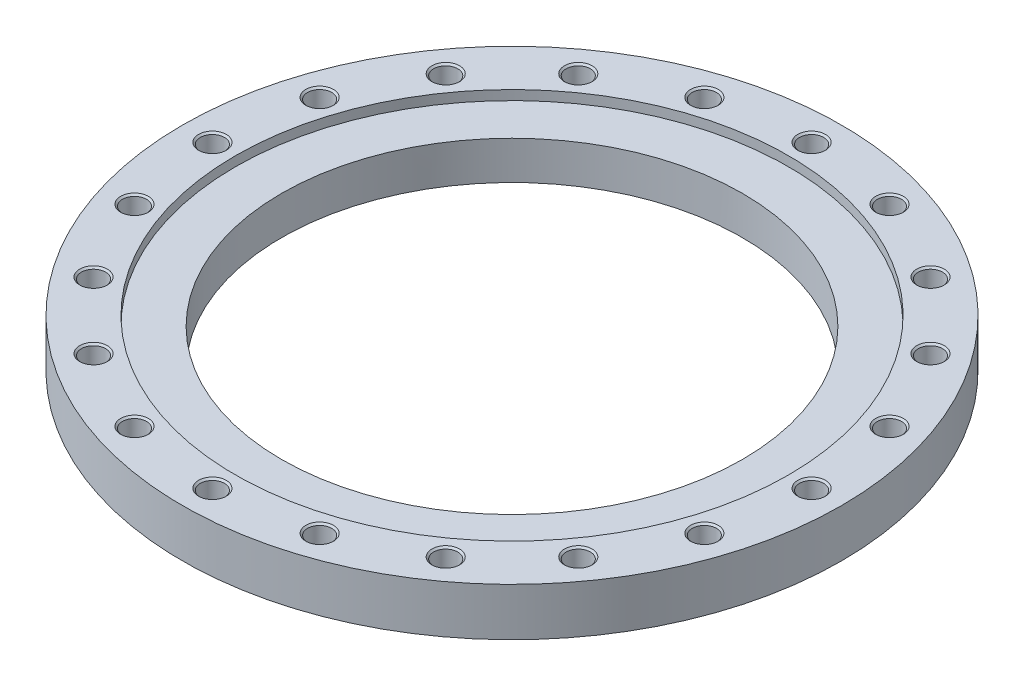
ISO-10303-21;
HEADER;
FILE_DESCRIPTION(('STEP AP214'),'2;1');
FILE_NAME('part.step','',(''),(''),'','','');
FILE_SCHEMA(('AUTOMOTIVE_DESIGN { 1 0 10303 214 1 1 1 1 }'));
ENDSEC;
DATA;
#1=APPLICATION_CONTEXT('core data for automotive mechanical design processes');
#2=APPLICATION_PROTOCOL_DEFINITION('international standard','automotive_design',2000,#1);
#3=PRODUCT_CONTEXT('',#1,'mechanical');
#4=PRODUCT('Part','Part','',(#3));
#5=PRODUCT_RELATED_PRODUCT_CATEGORY('part','',(#4));
#6=PRODUCT_DEFINITION_FORMATION('','',#4);
#7=PRODUCT_DEFINITION_CONTEXT('part definition',#1,'design');
#8=PRODUCT_DEFINITION('design','',#6,#7);
#9=PRODUCT_DEFINITION_SHAPE('','',#8);
#10=(LENGTH_UNIT() NAMED_UNIT(*) SI_UNIT(.MILLI.,.METRE.));
#11=(NAMED_UNIT(*) PLANE_ANGLE_UNIT() SI_UNIT($,.RADIAN.));
#12=(NAMED_UNIT(*) SI_UNIT($,.STERADIAN.) SOLID_ANGLE_UNIT());
#13=UNCERTAINTY_MEASURE_WITH_UNIT(LENGTH_MEASURE(1.E-05),#10,'distance_accuracy_value','');
#14=(GEOMETRIC_REPRESENTATION_CONTEXT(3) GLOBAL_UNCERTAINTY_ASSIGNED_CONTEXT((#13)) GLOBAL_UNIT_ASSIGNED_CONTEXT((#10,
#11,#12)) REPRESENTATION_CONTEXT('',''));
#15=CARTESIAN_POINT('',(0.,0.,0.));
#16=DIRECTION('',(0.,0.,1.));
#17=DIRECTION('',(1.,0.,0.));
#18=AXIS2_PLACEMENT_3D('',#15,#16,#17);
#19=CARTESIAN_POINT('',(0.,26.,0.));
#20=DIRECTION('',(0.,-1.,0.));
#21=DIRECTION('',(1.,0.,0.));
#22=AXIS2_PLACEMENT_3D('',#19,#20,#21);
#23=CYLINDRICAL_SURFACE('',#22,357.5);
#24=CARTESIAN_POINT('',(0.,0.,0.));
#25=DIRECTION('',(0.,1.,0.));
#26=DIRECTION('',(1.,0.,0.));
#27=AXIS2_PLACEMENT_3D('',#24,#25,#26);
#28=CIRCLE('',#27,357.5);
#29=CARTESIAN_POINT('',(357.5,0.,0.));
#30=VERTEX_POINT('',#29);
#31=EDGE_CURVE('E9',#30,#30,#28,.T.);
#32=ORIENTED_EDGE('',*,*,#31,.T.);
#33=EDGE_LOOP('',(#32));
#34=FACE_BOUND('',#33,.T.);
#35=CARTESIAN_POINT('',(0.,52.,0.));
#36=DIRECTION('',(0.,1.,0.));
#37=DIRECTION('',(1.,0.,0.));
#38=AXIS2_PLACEMENT_3D('',#35,#36,#37);
#39=CIRCLE('',#38,357.5);
#40=CARTESIAN_POINT('',(357.5,52.,0.));
#41=VERTEX_POINT('',#40);
#42=EDGE_CURVE('E598',#41,#41,#39,.T.);
#43=ORIENTED_EDGE('',*,*,#42,.F.);
#44=EDGE_LOOP('',(#43));
#45=FACE_BOUND('',#44,.T.);
#46=ADVANCED_FACE('F15',(#34,#45),#23,.T.);
#47=CARTESIAN_POINT('',(303.75,0.,0.));
#48=DIRECTION('',(0.,-1.,0.));
#49=DIRECTION('',(-1.,0.,0.));
#50=AXIS2_PLACEMENT_3D('',#47,#48,#49);
#51=PLANE('',#50);
#52=CARTESIAN_POINT('',(0.,0.,0.));
#53=DIRECTION('',(0.,1.,0.));
#54=DIRECTION('',(1.,0.,0.));
#55=AXIS2_PLACEMENT_3D('',#52,#53,#54);
#56=CIRCLE('',#55,250.);
#57=CARTESIAN_POINT('',(250.,0.,0.));
#58=VERTEX_POINT('',#57);
#59=EDGE_CURVE('E23',#58,#58,#56,.T.);
#60=ORIENTED_EDGE('',*,*,#59,.T.);
#61=EDGE_LOOP('',(#60));
#62=FACE_BOUND('',#61,.T.);
#63=ORIENTED_EDGE('',*,*,#31,.F.);
#64=EDGE_LOOP('',(#63));
#65=FACE_BOUND('',#64,.T.);
#66=ADVANCED_FACE('F17',(#62,#65),#51,.T.);
#67=CARTESIAN_POINT('',(0.,26.,0.));
#68=DIRECTION('',(0.,-1.,0.));
#69=DIRECTION('',(1.,0.,0.));
#70=AXIS2_PLACEMENT_3D('',#67,#68,#69);
#71=CYLINDRICAL_SURFACE('',#70,250.);
#72=ORIENTED_EDGE('',*,*,#59,.F.);
#73=EDGE_LOOP('',(#72));
#74=FACE_BOUND('',#73,.T.);
#75=CARTESIAN_POINT('',(0.,41.6,0.));
#76=DIRECTION('',(0.,1.,0.));
#77=DIRECTION('',(1.,0.,0.));
#78=AXIS2_PLACEMENT_3D('',#75,#76,#77);
#79=CIRCLE('',#78,250.);
#80=CARTESIAN_POINT('',(-250.,41.6,0.));
#81=VERTEX_POINT('',#80);
#82=EDGE_CURVE('E596',#81,#81,#79,.T.);
#83=ORIENTED_EDGE('',*,*,#82,.T.);
#84=EDGE_LOOP('',(#83));
#85=FACE_BOUND('',#84,.T.);
#86=ADVANCED_FACE('F691',(#74,#85),#71,.F.);
#87=CARTESIAN_POINT('',(303.75,52.,0.));
#88=DIRECTION('',(0.,1.,0.));
#89=DIRECTION('',(1.,0.,0.));
#90=AXIS2_PLACEMENT_3D('',#87,#88,#89);
#91=PLANE('',#90);
#92=ORIENTED_EDGE('',*,*,#42,.T.);
#93=EDGE_LOOP('',(#92));
#94=FACE_BOUND('',#93,.T.);
#95=CARTESIAN_POINT('',(0.,52.,0.));
#96=DIRECTION('',(0.,-1.,0.));
#97=DIRECTION('',(1.,0.,0.));
#98=AXIS2_PLACEMENT_3D('',#95,#96,#97);
#99=CIRCLE('',#98,300.);
#100=CARTESIAN_POINT('',(-300.,52.,0.));
#101=VERTEX_POINT('',#100);
#102=EDGE_CURVE('E515',#101,#101,#99,.T.);
#103=ORIENTED_EDGE('',*,*,#102,.T.);
#104=EDGE_LOOP('',(#103));
#105=FACE_BOUND('',#104,.T.);
#106=CARTESIAN_POINT('',(325.,52.,0.));
#107=DIRECTION('',(0.,-1.,0.));
#108=DIRECTION('',(1.,0.,0.));
#109=AXIS2_PLACEMENT_3D('',#106,#107,#108);
#110=CIRCLE('',#109,15.);
#111=CARTESIAN_POINT('',(340.,52.,0.));
#112=VERTEX_POINT('',#111);
#113=EDGE_CURVE('E484',#112,#112,#110,.T.);
#114=ORIENTED_EDGE('',*,*,#113,.T.);
#115=EDGE_LOOP('',(#114));
#116=FACE_BOUND('',#115,.T.);
#117=CARTESIAN_POINT('',(309.093367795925,52.,-100.430523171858));
#118=DIRECTION('',(0.,-1.,0.));
#119=DIRECTION('',(0.951056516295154,0.,-0.309016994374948));
#120=AXIS2_PLACEMENT_3D('',#117,#118,#119);
#121=CIRCLE('',#120,15.);
#122=CARTESIAN_POINT('',(323.359215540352,52.,-105.065778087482));
#123=VERTEX_POINT('',#122);
#124=EDGE_CURVE('E582',#123,#123,#121,.T.);
#125=ORIENTED_EDGE('',*,*,#124,.T.);
#126=EDGE_LOOP('',(#125));
#127=FACE_BOUND('',#126,.T.);
#128=CARTESIAN_POINT('',(262.930523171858,52.,-191.030206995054));
#129=DIRECTION('',(0.,-1.,0.));
#130=DIRECTION('',(0.809016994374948,0.,-0.587785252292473));
#131=AXIS2_PLACEMENT_3D('',#128,#129,#130);
#132=CIRCLE('',#131,15.);
#133=CARTESIAN_POINT('',(275.065778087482,52.,-199.846985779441));
#134=VERTEX_POINT('',#133);
#135=EDGE_CURVE('E555',#134,#134,#132,.T.);
#136=ORIENTED_EDGE('',*,*,#135,.T.);
#137=EDGE_LOOP('',(#136));
#138=FACE_BOUND('',#137,.T.);
#139=CARTESIAN_POINT('',(191.030206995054,52.,-262.930523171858));
#140=DIRECTION('',(0.,-1.,0.));
#141=DIRECTION('',(0.587785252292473,0.,-0.809016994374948));
#142=AXIS2_PLACEMENT_3D('',#139,#140,#141);
#143=CIRCLE('',#142,15.);
#144=CARTESIAN_POINT('',(199.846985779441,52.,-275.065778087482));
#145=VERTEX_POINT('',#144);
#146=EDGE_CURVE('E497',#145,#145,#143,.T.);
#147=ORIENTED_EDGE('',*,*,#146,.T.);
#148=EDGE_LOOP('',(#147));
#149=FACE_BOUND('',#148,.T.);
#150=CARTESIAN_POINT('',(100.430523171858,52.,-309.093367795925));
#151=DIRECTION('',(0.,-1.,0.));
#152=DIRECTION('',(0.309016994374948,0.,-0.951056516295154));
#153=AXIS2_PLACEMENT_3D('',#150,#151,#152);
#154=CIRCLE('',#153,15.);
#155=CARTESIAN_POINT('',(105.065778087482,52.,-323.359215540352));
#156=VERTEX_POINT('',#155);
#157=EDGE_CURVE('E664',#156,#156,#154,.T.);
#158=ORIENTED_EDGE('',*,*,#157,.T.);
#159=EDGE_LOOP('',(#158));
#160=FACE_BOUND('',#159,.T.);
#161=CARTESIAN_POINT('',(0.,52.,-325.));
#162=DIRECTION('',(0.,-1.,0.));
#163=DIRECTION('',(0.,0.,-1.));
#164=AXIS2_PLACEMENT_3D('',#161,#162,#163);
#165=CIRCLE('',#164,15.);
#166=CARTESIAN_POINT('',(0.,52.,-340.));
#167=VERTEX_POINT('',#166);
#168=EDGE_CURVE('E652',#167,#167,#165,.T.);
#169=ORIENTED_EDGE('',*,*,#168,.T.);
#170=EDGE_LOOP('',(#169));
#171=FACE_BOUND('',#170,.T.);
#172=CARTESIAN_POINT('',(-100.430523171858,52.,-309.093367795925));
#173=DIRECTION('',(0.,-1.,0.));
#174=DIRECTION('',(-0.309016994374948,0.,-0.951056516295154));
#175=AXIS2_PLACEMENT_3D('',#172,#173,#174);
#176=CIRCLE('',#175,15.);
#177=CARTESIAN_POINT('',(-105.065778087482,52.,-323.359215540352));
#178=VERTEX_POINT('',#177);
#179=EDGE_CURVE('E468',#178,#178,#176,.T.);
#180=ORIENTED_EDGE('',*,*,#179,.T.);
#181=EDGE_LOOP('',(#180));
#182=FACE_BOUND('',#181,.T.);
#183=CARTESIAN_POINT('',(-191.030206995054,52.,-262.930523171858));
#184=DIRECTION('',(0.,-1.,0.));
#185=DIRECTION('',(-0.587785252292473,0.,-0.809016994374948));
#186=AXIS2_PLACEMENT_3D('',#183,#184,#185);
#187=CIRCLE('',#186,15.);
#188=CARTESIAN_POINT('',(-199.846985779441,52.,-275.065778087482));
#189=VERTEX_POINT('',#188);
#190=EDGE_CURVE('E507',#189,#189,#187,.T.);
#191=ORIENTED_EDGE('',*,*,#190,.T.);
#192=EDGE_LOOP('',(#191));
#193=FACE_BOUND('',#192,.T.);
#194=CARTESIAN_POINT('',(-262.930523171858,52.,-191.030206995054));
#195=DIRECTION('',(0.,-1.,0.));
#196=DIRECTION('',(-0.809016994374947,0.,-0.587785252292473));
#197=AXIS2_PLACEMENT_3D('',#194,#195,#196);
#198=CIRCLE('',#197,15.);
#199=CARTESIAN_POINT('',(-275.065778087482,52.,-199.846985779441));
#200=VERTEX_POINT('',#199);
#201=EDGE_CURVE('E632',#200,#200,#198,.T.);
#202=ORIENTED_EDGE('',*,*,#201,.T.);
#203=EDGE_LOOP('',(#202));
#204=FACE_BOUND('',#203,.T.);
#205=CARTESIAN_POINT('',(-309.093367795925,52.,-100.430523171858));
#206=DIRECTION('',(0.,-1.,0.));
#207=DIRECTION('',(-0.951056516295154,0.,-0.309016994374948));
#208=AXIS2_PLACEMENT_3D('',#205,#206,#207);
#209=CIRCLE('',#208,15.);
#210=CARTESIAN_POINT('',(-323.359215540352,52.,-105.065778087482));
#211=VERTEX_POINT('',#210);
#212=EDGE_CURVE('E627',#211,#211,#209,.T.);
#213=ORIENTED_EDGE('',*,*,#212,.T.);
#214=EDGE_LOOP('',(#213));
#215=FACE_BOUND('',#214,.T.);
#216=CARTESIAN_POINT('',(-325.,52.,0.));
#217=DIRECTION('',(0.,-1.,0.));
#218=DIRECTION('',(-1.,0.,0.));
#219=AXIS2_PLACEMENT_3D('',#216,#217,#218);
#220=CIRCLE('',#219,15.);
#221=CARTESIAN_POINT('',(-340.,52.,0.));
#222=VERTEX_POINT('',#221);
#223=EDGE_CURVE('E492',#222,#222,#220,.T.);
#224=ORIENTED_EDGE('',*,*,#223,.T.);
#225=EDGE_LOOP('',(#224));
#226=FACE_BOUND('',#225,.T.);
#227=CARTESIAN_POINT('',(-309.093367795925,52.,100.430523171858));
#228=DIRECTION('',(0.,-1.,0.));
#229=DIRECTION('',(-0.951056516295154,0.,0.309016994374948));
#230=AXIS2_PLACEMENT_3D('',#227,#228,#229);
#231=CIRCLE('',#230,15.);
#232=CARTESIAN_POINT('',(-323.359215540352,52.,105.065778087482));
#233=VERTEX_POINT('',#232);
#234=EDGE_CURVE('E595',#233,#233,#231,.T.);
#235=ORIENTED_EDGE('',*,*,#234,.T.);
#236=EDGE_LOOP('',(#235));
#237=FACE_BOUND('',#236,.T.);
#238=CARTESIAN_POINT('',(-262.930523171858,52.,191.030206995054));
#239=DIRECTION('',(0.,-1.,0.));
#240=DIRECTION('',(-0.809016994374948,0.,0.587785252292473));
#241=AXIS2_PLACEMENT_3D('',#238,#239,#240);
#242=CIRCLE('',#241,15.);
#243=CARTESIAN_POINT('',(-275.065778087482,52.,199.846985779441));
#244=VERTEX_POINT('',#243);
#245=EDGE_CURVE('E588',#244,#244,#242,.T.);
#246=ORIENTED_EDGE('',*,*,#245,.T.);
#247=EDGE_LOOP('',(#246));
#248=FACE_BOUND('',#247,.T.);
#249=CARTESIAN_POINT('',(-191.030206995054,52.,262.930523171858));
#250=DIRECTION('',(0.,-1.,0.));
#251=DIRECTION('',(-0.587785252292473,0.,0.809016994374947));
#252=AXIS2_PLACEMENT_3D('',#249,#250,#251);
#253=CIRCLE('',#252,15.);
#254=CARTESIAN_POINT('',(-199.846985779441,52.,275.065778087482));
#255=VERTEX_POINT('',#254);
#256=EDGE_CURVE('E568',#255,#255,#253,.T.);
#257=ORIENTED_EDGE('',*,*,#256,.T.);
#258=EDGE_LOOP('',(#257));
#259=FACE_BOUND('',#258,.T.);
#260=CARTESIAN_POINT('',(-100.430523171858,52.,309.093367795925));
#261=DIRECTION('',(0.,-1.,0.));
#262=DIRECTION('',(-0.309016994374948,0.,0.951056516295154));
#263=AXIS2_PLACEMENT_3D('',#260,#261,#262);
#264=CIRCLE('',#263,15.);
#265=CARTESIAN_POINT('',(-105.065778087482,52.,323.359215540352));
#266=VERTEX_POINT('',#265);
#267=EDGE_CURVE('E562',#266,#266,#264,.T.);
#268=ORIENTED_EDGE('',*,*,#267,.T.);
#269=EDGE_LOOP('',(#268));
#270=FACE_BOUND('',#269,.T.);
#271=CARTESIAN_POINT('',(0.,52.,325.));
#272=DIRECTION('',(0.,-1.,0.));
#273=DIRECTION('',(0.,0.,1.));
#274=AXIS2_PLACEMENT_3D('',#271,#272,#273);
#275=CIRCLE('',#274,15.);
#276=CARTESIAN_POINT('',(0.,52.,340.));
#277=VERTEX_POINT('',#276);
#278=EDGE_CURVE('E544',#277,#277,#275,.T.);
#279=ORIENTED_EDGE('',*,*,#278,.T.);
#280=EDGE_LOOP('',(#279));
#281=FACE_BOUND('',#280,.T.);
#282=CARTESIAN_POINT('',(100.430523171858,52.,309.093367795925));
#283=DIRECTION('',(0.,-1.,0.));
#284=DIRECTION('',(0.309016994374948,0.,0.951056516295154));
#285=AXIS2_PLACEMENT_3D('',#282,#283,#284);
#286=CIRCLE('',#285,15.);
#287=CARTESIAN_POINT('',(105.065778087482,52.,323.359215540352));
#288=VERTEX_POINT('',#287);
#289=EDGE_CURVE('E520',#288,#288,#286,.T.);
#290=ORIENTED_EDGE('',*,*,#289,.T.);
#291=EDGE_LOOP('',(#290));
#292=FACE_BOUND('',#291,.T.);
#293=CARTESIAN_POINT('',(191.030206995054,52.,262.930523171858));
#294=DIRECTION('',(0.,-1.,0.));
#295=DIRECTION('',(0.587785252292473,0.,0.809016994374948));
#296=AXIS2_PLACEMENT_3D('',#293,#294,#295);
#297=CIRCLE('',#296,15.);
#298=CARTESIAN_POINT('',(199.846985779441,52.,275.065778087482));
#299=VERTEX_POINT('',#298);
#300=EDGE_CURVE('E496',#299,#299,#297,.T.);
#301=ORIENTED_EDGE('',*,*,#300,.T.);
#302=EDGE_LOOP('',(#301));
#303=FACE_BOUND('',#302,.T.);
#304=CARTESIAN_POINT('',(262.930523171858,52.,191.030206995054));
#305=DIRECTION('',(0.,-1.,0.));
#306=DIRECTION('',(0.809016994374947,0.,0.587785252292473));
#307=AXIS2_PLACEMENT_3D('',#304,#305,#306);
#308=CIRCLE('',#307,15.);
#309=CARTESIAN_POINT('',(275.065778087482,52.,199.846985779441));
#310=VERTEX_POINT('',#309);
#311=EDGE_CURVE('E1208',#310,#310,#308,.T.);
#312=ORIENTED_EDGE('',*,*,#311,.T.);
#313=EDGE_LOOP('',(#312));
#314=FACE_BOUND('',#313,.T.);
#315=CARTESIAN_POINT('',(309.093367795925,52.,100.430523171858));
#316=DIRECTION('',(0.,-1.,0.));
#317=DIRECTION('',(0.951056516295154,0.,0.309016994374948));
#318=AXIS2_PLACEMENT_3D('',#315,#316,#317);
#319=CIRCLE('',#318,15.);
#320=CARTESIAN_POINT('',(323.359215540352,52.,105.065778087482));
#321=VERTEX_POINT('',#320);
#322=EDGE_CURVE('E1236',#321,#321,#319,.T.);
#323=ORIENTED_EDGE('',*,*,#322,.T.);
#324=EDGE_LOOP('',(#323));
#325=FACE_BOUND('',#324,.T.);
#326=ADVANCED_FACE('F682',(#94,#105,#116,#127,#138,#149,#160,#171,#182,#193,#204,#215,#226,#237,
#248,#259,#270,#281,#292,#303,#314,#325),#91,.T.);
#327=CARTESIAN_POINT('',(0.,41.6,0.));
#328=DIRECTION('',(0.,-1.,0.));
#329=DIRECTION('',(-1.,0.,0.));
#330=AXIS2_PLACEMENT_3D('',#327,#328,#329);
#331=PLANE('',#330);
#332=CARTESIAN_POINT('',(0.,41.6,0.));
#333=DIRECTION('',(0.,-1.,0.));
#334=DIRECTION('',(1.,0.,0.));
#335=AXIS2_PLACEMENT_3D('',#332,#333,#334);
#336=CIRCLE('',#335,300.);
#337=CARTESIAN_POINT('',(300.,41.6,0.));
#338=VERTEX_POINT('',#337);
#339=EDGE_CURVE('E517',#338,#338,#336,.T.);
#340=ORIENTED_EDGE('',*,*,#339,.F.);
#341=EDGE_LOOP('',(#340));
#342=FACE_BOUND('',#341,.T.);
#343=ORIENTED_EDGE('',*,*,#82,.F.);
#344=EDGE_LOOP('',(#343));
#345=FACE_BOUND('',#344,.T.);
#346=ADVANCED_FACE('F894',(#342,#345),#331,.F.);
#347=CARTESIAN_POINT('',(0.,49.4,0.));
#348=DIRECTION('',(0.,-1.,0.));
#349=DIRECTION('',(1.,0.,0.));
#350=AXIS2_PLACEMENT_3D('',#347,#348,#349);
#351=CYLINDRICAL_SURFACE('',#350,300.);
#352=ORIENTED_EDGE('',*,*,#339,.T.);
#353=EDGE_LOOP('',(#352));
#354=FACE_BOUND('',#353,.T.);
#355=ORIENTED_EDGE('',*,*,#102,.F.);
#356=EDGE_LOOP('',(#355));
#357=FACE_BOUND('',#356,.T.);
#358=ADVANCED_FACE('F951',(#354,#357),#351,.F.);
#359=CARTESIAN_POINT('',(325.,8.21673193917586,0.));
#360=DIRECTION('',(0.,1.,0.));
#361=DIRECTION('',(1.,0.,0.));
#362=AXIS2_PLACEMENT_3D('',#359,#360,#361);
#363=CONICAL_SURFACE('',#362,6.5528125,1.0471975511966);
#364=CARTESIAN_POINT('',(325.,12.,0.));
#365=DIRECTION('',(0.,-1.,0.));
#366=DIRECTION('',(1.,0.,0.));
#367=AXIS2_PLACEMENT_3D('',#364,#365,#366);
#368=CIRCLE('',#367,13.105625);
#369=CARTESIAN_POINT('',(338.105625,12.,0.));
#370=VERTEX_POINT('',#369);
#371=EDGE_CURVE('E518',#370,#370,#368,.T.);
#372=ORIENTED_EDGE('',*,*,#371,.F.);
#373=EDGE_LOOP('',(#372));
#374=FACE_BOUND('',#373,.T.);
#375=CARTESIAN_POINT('',(325.,4.43346387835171,0.));
#376=VERTEX_POINT('',#375);
#377=VERTEX_LOOP('',#376);
#378=FACE_BOUND('',#377,.T.);
#379=ADVANCED_FACE('F776',(#374,#378),#363,.F.);
#380=CARTESIAN_POINT('',(325.,16.0528125,0.));
#381=DIRECTION('',(0.,1.,0.));
#382=DIRECTION('',(1.,0.,0.));
#383=AXIS2_PLACEMENT_3D('',#380,#381,#382);
#384=CYLINDRICAL_SURFACE('',#383,13.105625);
#385=CARTESIAN_POINT('',(325.,20.105625,0.));
#386=DIRECTION('',(0.,-1.,0.));
#387=DIRECTION('',(1.,0.,0.));
#388=AXIS2_PLACEMENT_3D('',#385,#386,#387);
#389=CIRCLE('',#388,13.105625);
#390=CARTESIAN_POINT('',(338.105625,20.105625,0.));
#391=VERTEX_POINT('',#390);
#392=EDGE_CURVE('E614',#391,#391,#389,.T.);
#393=ORIENTED_EDGE('',*,*,#392,.F.);
#394=EDGE_LOOP('',(#393));
#395=FACE_BOUND('',#394,.T.);
#396=ORIENTED_EDGE('',*,*,#371,.T.);
#397=EDGE_LOOP('',(#396));
#398=FACE_BOUND('',#397,.T.);
#399=ADVANCED_FACE('F772',(#395,#398),#384,.F.);
#400=CARTESIAN_POINT('',(325.,21.0528125,0.));
#401=DIRECTION('',(0.,1.,0.));
#402=DIRECTION('',(1.,0.,0.));
#403=AXIS2_PLACEMENT_3D('',#400,#401,#402);
#404=CONICAL_SURFACE('',#403,14.0528125,0.785398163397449);
#405=CARTESIAN_POINT('',(325.,22.,0.));
#406=DIRECTION('',(0.,-1.,0.));
#407=DIRECTION('',(1.,0.,0.));
#408=AXIS2_PLACEMENT_3D('',#405,#406,#407);
#409=CIRCLE('',#408,15.);
#410=CARTESIAN_POINT('',(340.,22.,0.));
#411=VERTEX_POINT('',#410);
#412=EDGE_CURVE('E483',#411,#411,#409,.T.);
#413=ORIENTED_EDGE('',*,*,#412,.F.);
#414=EDGE_LOOP('',(#413));
#415=FACE_BOUND('',#414,.T.);
#416=ORIENTED_EDGE('',*,*,#392,.T.);
#417=EDGE_LOOP('',(#416));
#418=FACE_BOUND('',#417,.T.);
#419=ADVANCED_FACE('F775',(#415,#418),#404,.F.);
#420=CARTESIAN_POINT('',(339.0528125,22.,0.));
#421=DIRECTION('',(0.,1.,0.));
#422=DIRECTION('',(-1.,0.,0.));
#423=AXIS2_PLACEMENT_3D('',#420,#421,#422);
#424=PLANE('',#423);
#425=CARTESIAN_POINT('',(325.,22.,0.));
#426=DIRECTION('',(0.,-1.,0.));
#427=DIRECTION('',(1.,0.,0.));
#428=AXIS2_PLACEMENT_3D('',#425,#426,#427);
#429=CIRCLE('',#428,13.105625);
#430=CARTESIAN_POINT('',(338.105625,22.,0.));
#431=VERTEX_POINT('',#430);
#432=EDGE_CURVE('E481',#431,#431,#429,.T.);
#433=ORIENTED_EDGE('',*,*,#432,.F.);
#434=EDGE_LOOP('',(#433));
#435=FACE_BOUND('',#434,.T.);
#436=ORIENTED_EDGE('',*,*,#412,.T.);
#437=EDGE_LOOP('',(#436));
#438=FACE_BOUND('',#437,.T.);
#439=ADVANCED_FACE('F736',(#435,#438),#424,.F.);
#440=CARTESIAN_POINT('',(325.,36.0528125,0.));
#441=DIRECTION('',(0.,1.,0.));
#442=DIRECTION('',(1.,0.,0.));
#443=AXIS2_PLACEMENT_3D('',#440,#441,#442);
#444=CYLINDRICAL_SURFACE('',#443,13.105625);
#445=CARTESIAN_POINT('',(325.,50.105625,0.));
#446=DIRECTION('',(0.,-1.,0.));
#447=DIRECTION('',(1.,0.,0.));
#448=AXIS2_PLACEMENT_3D('',#445,#446,#447);
#449=CIRCLE('',#448,13.105625);
#450=CARTESIAN_POINT('',(338.105625,50.105625,0.));
#451=VERTEX_POINT('',#450);
#452=EDGE_CURVE('E523',#451,#451,#449,.T.);
#453=ORIENTED_EDGE('',*,*,#452,.F.);
#454=EDGE_LOOP('',(#453));
#455=FACE_BOUND('',#454,.T.);
#456=ORIENTED_EDGE('',*,*,#432,.T.);
#457=EDGE_LOOP('',(#456));
#458=FACE_BOUND('',#457,.T.);
#459=ADVANCED_FACE('F732',(#455,#458),#444,.F.);
#460=CARTESIAN_POINT('',(325.,51.0528125,0.));
#461=DIRECTION('',(0.,1.,0.));
#462=DIRECTION('',(1.,0.,0.));
#463=AXIS2_PLACEMENT_3D('',#460,#461,#462);
#464=CONICAL_SURFACE('',#463,14.0528125,0.785398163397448);
#465=ORIENTED_EDGE('',*,*,#113,.F.);
#466=EDGE_LOOP('',(#465));
#467=FACE_BOUND('',#466,.T.);
#468=ORIENTED_EDGE('',*,*,#452,.T.);
#469=EDGE_LOOP('',(#468));
#470=FACE_BOUND('',#469,.T.);
#471=ADVANCED_FACE('F735',(#467,#470),#464,.F.);
#472=CARTESIAN_POINT('',(309.093367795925,8.21673193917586,-100.430523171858));
#473=DIRECTION('',(0.,1.,0.));
#474=DIRECTION('',(0.951056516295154,0.,-0.309016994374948));
#475=AXIS2_PLACEMENT_3D('',#472,#473,#474);
#476=CONICAL_SURFACE('',#475,6.5528125,1.0471975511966);
#477=CARTESIAN_POINT('',(309.093367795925,12.,-100.430523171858));
#478=DIRECTION('',(0.,-1.,0.));
#479=DIRECTION('',(0.951056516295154,0.,-0.309016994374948));
#480=AXIS2_PLACEMENT_3D('',#477,#478,#479);
#481=CIRCLE('',#480,13.105625);
#482=CARTESIAN_POINT('',(321.557557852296,12.,-104.480384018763));
#483=VERTEX_POINT('',#482);
#484=EDGE_CURVE('E525',#483,#483,#481,.T.);
#485=ORIENTED_EDGE('',*,*,#484,.F.);
#486=EDGE_LOOP('',(#485));
#487=FACE_BOUND('',#486,.T.);
#488=CARTESIAN_POINT('',(309.093367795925,4.43346387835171,-100.430523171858));
#489=VERTEX_POINT('',#488);
#490=VERTEX_LOOP('',#489);
#491=FACE_BOUND('',#490,.T.);
#492=ADVANCED_FACE('F800',(#487,#491),#476,.F.);
#493=CARTESIAN_POINT('',(309.093367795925,16.0528125,-100.430523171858));
#494=DIRECTION('',(0.,1.,0.));
#495=DIRECTION('',(0.951056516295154,0.,-0.309016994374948));
#496=AXIS2_PLACEMENT_3D('',#493,#494,#495);
#497=CYLINDRICAL_SURFACE('',#496,13.105625);
#498=CARTESIAN_POINT('',(309.093367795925,20.105625,-100.430523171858));
#499=DIRECTION('',(0.,-1.,0.));
#500=DIRECTION('',(0.951056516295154,0.,-0.309016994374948));
#501=AXIS2_PLACEMENT_3D('',#498,#499,#500);
#502=CIRCLE('',#501,13.105625);
#503=CARTESIAN_POINT('',(321.557557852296,20.105625,-104.480384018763));
#504=VERTEX_POINT('',#503);
#505=EDGE_CURVE('E576',#504,#504,#502,.T.);
#506=ORIENTED_EDGE('',*,*,#505,.F.);
#507=EDGE_LOOP('',(#506));
#508=FACE_BOUND('',#507,.T.);
#509=ORIENTED_EDGE('',*,*,#484,.T.);
#510=EDGE_LOOP('',(#509));
#511=FACE_BOUND('',#510,.T.);
#512=ADVANCED_FACE('F796',(#508,#511),#497,.F.);
#513=CARTESIAN_POINT('',(309.093367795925,21.0528125,-100.430523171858));
#514=DIRECTION('',(0.,1.,0.));
#515=DIRECTION('',(0.951056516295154,0.,-0.309016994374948));
#516=AXIS2_PLACEMENT_3D('',#513,#514,#515);
#517=CONICAL_SURFACE('',#516,14.0528125,0.785398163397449);
#518=CARTESIAN_POINT('',(309.093367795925,22.,-100.430523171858));
#519=DIRECTION('',(0.,-1.,0.));
#520=DIRECTION('',(0.951056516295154,0.,-0.309016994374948));
#521=AXIS2_PLACEMENT_3D('',#518,#519,#520);
#522=CIRCLE('',#521,15.);
#523=CARTESIAN_POINT('',(323.359215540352,22.,-105.065778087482));
#524=VERTEX_POINT('',#523);
#525=EDGE_CURVE('E581',#524,#524,#522,.T.);
#526=ORIENTED_EDGE('',*,*,#525,.F.);
#527=EDGE_LOOP('',(#526));
#528=FACE_BOUND('',#527,.T.);
#529=ORIENTED_EDGE('',*,*,#505,.T.);
#530=EDGE_LOOP('',(#529));
#531=FACE_BOUND('',#530,.T.);
#532=ADVANCED_FACE('F799',(#528,#531),#517,.F.);
#533=CARTESIAN_POINT('',(322.458386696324,22.,-104.773081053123));
#534=DIRECTION('',(0.,1.,0.));
#535=DIRECTION('',(-0.951056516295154,0.,0.309016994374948));
#536=AXIS2_PLACEMENT_3D('',#533,#534,#535);
#537=PLANE('',#536);
#538=CARTESIAN_POINT('',(309.093367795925,22.,-100.430523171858));
#539=DIRECTION('',(0.,-1.,0.));
#540=DIRECTION('',(0.951056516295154,0.,-0.309016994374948));
#541=AXIS2_PLACEMENT_3D('',#538,#539,#540);
#542=CIRCLE('',#541,13.105625);
#543=CARTESIAN_POINT('',(321.557557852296,22.,-104.480384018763));
#544=VERTEX_POINT('',#543);
#545=EDGE_CURVE('E579',#544,#544,#542,.T.);
#546=ORIENTED_EDGE('',*,*,#545,.F.);
#547=EDGE_LOOP('',(#546));
#548=FACE_BOUND('',#547,.T.);
#549=ORIENTED_EDGE('',*,*,#525,.T.);
#550=EDGE_LOOP('',(#549));
#551=FACE_BOUND('',#550,.T.);
#552=ADVANCED_FACE('F720',(#548,#551),#537,.F.);
#553=CARTESIAN_POINT('',(309.093367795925,36.0528125,-100.430523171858));
#554=DIRECTION('',(0.,1.,0.));
#555=DIRECTION('',(0.951056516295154,0.,-0.309016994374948));
#556=AXIS2_PLACEMENT_3D('',#553,#554,#555);
#557=CYLINDRICAL_SURFACE('',#556,13.105625);
#558=CARTESIAN_POINT('',(309.093367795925,50.105625,-100.430523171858));
#559=DIRECTION('',(0.,-1.,0.));
#560=DIRECTION('',(0.951056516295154,0.,-0.309016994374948));
#561=AXIS2_PLACEMENT_3D('',#558,#559,#560);
#562=CIRCLE('',#561,13.105625);
#563=CARTESIAN_POINT('',(321.557557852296,50.105625,-104.480384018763));
#564=VERTEX_POINT('',#563);
#565=EDGE_CURVE('E607',#564,#564,#562,.T.);
#566=ORIENTED_EDGE('',*,*,#565,.F.);
#567=EDGE_LOOP('',(#566));
#568=FACE_BOUND('',#567,.T.);
#569=ORIENTED_EDGE('',*,*,#545,.T.);
#570=EDGE_LOOP('',(#569));
#571=FACE_BOUND('',#570,.T.);
#572=ADVANCED_FACE('F716',(#568,#571),#557,.F.);
#573=CARTESIAN_POINT('',(309.093367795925,51.0528125,-100.430523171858));
#574=DIRECTION('',(0.,1.,0.));
#575=DIRECTION('',(0.951056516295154,0.,-0.309016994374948));
#576=AXIS2_PLACEMENT_3D('',#573,#574,#575);
#577=CONICAL_SURFACE('',#576,14.0528125,0.785398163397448);
#578=ORIENTED_EDGE('',*,*,#124,.F.);
#579=EDGE_LOOP('',(#578));
#580=FACE_BOUND('',#579,.T.);
#581=ORIENTED_EDGE('',*,*,#565,.T.);
#582=EDGE_LOOP('',(#581));
#583=FACE_BOUND('',#582,.T.);
#584=ADVANCED_FACE('F719',(#580,#583),#577,.F.);
#585=CARTESIAN_POINT('',(262.930523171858,8.21673193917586,-191.030206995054));
#586=DIRECTION('',(0.,1.,0.));
#587=DIRECTION('',(0.809016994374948,0.,-0.587785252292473));
#588=AXIS2_PLACEMENT_3D('',#585,#586,#587);
#589=CONICAL_SURFACE('',#588,6.5528125,1.0471975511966);
#590=CARTESIAN_POINT('',(262.930523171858,12.,-191.030206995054));
#591=DIRECTION('',(0.,-1.,0.));
#592=DIRECTION('',(0.809016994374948,0.,-0.587785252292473));
#593=AXIS2_PLACEMENT_3D('',#590,#591,#592);
#594=CIRCLE('',#593,13.105625);
#595=CARTESIAN_POINT('',(273.533196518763,12.,-198.73350009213));
#596=VERTEX_POINT('',#595);
#597=EDGE_CURVE('E605',#596,#596,#594,.T.);
#598=ORIENTED_EDGE('',*,*,#597,.F.);
#599=EDGE_LOOP('',(#598));
#600=FACE_BOUND('',#599,.T.);
#601=CARTESIAN_POINT('',(262.930523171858,4.43346387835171,-191.030206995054));
#602=VERTEX_POINT('',#601);
#603=VERTEX_LOOP('',#602);
#604=FACE_BOUND('',#603,.T.);
#605=ADVANCED_FACE('F762',(#600,#604),#589,.F.);
#606=CARTESIAN_POINT('',(262.930523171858,16.0528125,-191.030206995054));
#607=DIRECTION('',(0.,1.,0.));
#608=DIRECTION('',(0.809016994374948,0.,-0.587785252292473));
#609=AXIS2_PLACEMENT_3D('',#606,#607,#608);
#610=CYLINDRICAL_SURFACE('',#609,13.105625);
#611=CARTESIAN_POINT('',(262.930523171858,20.105625,-191.030206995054));
#612=DIRECTION('',(0.,-1.,0.));
#613=DIRECTION('',(0.809016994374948,0.,-0.587785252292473));
#614=AXIS2_PLACEMENT_3D('',#611,#612,#613);
#615=CIRCLE('',#614,13.105625);
#616=CARTESIAN_POINT('',(273.533196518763,20.105625,-198.73350009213));
#617=VERTEX_POINT('',#616);
#618=EDGE_CURVE('E608',#617,#617,#615,.T.);
#619=ORIENTED_EDGE('',*,*,#618,.F.);
#620=EDGE_LOOP('',(#619));
#621=FACE_BOUND('',#620,.T.);
#622=ORIENTED_EDGE('',*,*,#597,.T.);
#623=EDGE_LOOP('',(#622));
#624=FACE_BOUND('',#623,.T.);
#625=ADVANCED_FACE('F765',(#621,#624),#610,.F.);
#626=CARTESIAN_POINT('',(262.930523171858,21.0528125,-191.030206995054));
#627=DIRECTION('',(0.,1.,0.));
#628=DIRECTION('',(0.809016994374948,0.,-0.587785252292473));
#629=AXIS2_PLACEMENT_3D('',#626,#627,#628);
#630=CONICAL_SURFACE('',#629,14.0528125,0.785398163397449);
#631=CARTESIAN_POINT('',(262.930523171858,22.,-191.030206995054));
#632=DIRECTION('',(0.,-1.,0.));
#633=DIRECTION('',(0.809016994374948,0.,-0.587785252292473));
#634=AXIS2_PLACEMENT_3D('',#631,#632,#633);
#635=CIRCLE('',#634,15.);
#636=CARTESIAN_POINT('',(275.065778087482,22.,-199.846985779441));
#637=VERTEX_POINT('',#636);
#638=EDGE_CURVE('E676',#637,#637,#635,.T.);
#639=ORIENTED_EDGE('',*,*,#638,.F.);
#640=EDGE_LOOP('',(#639));
#641=FACE_BOUND('',#640,.T.);
#642=ORIENTED_EDGE('',*,*,#618,.T.);
#643=EDGE_LOOP('',(#642));
#644=FACE_BOUND('',#643,.T.);
#645=ADVANCED_FACE('F934',(#641,#644),#630,.F.);
#646=CARTESIAN_POINT('',(274.299487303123,22.,-199.290242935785));
#647=DIRECTION('',(0.,1.,0.));
#648=DIRECTION('',(-0.809016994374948,0.,0.587785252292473));
#649=AXIS2_PLACEMENT_3D('',#646,#647,#648);
#650=PLANE('',#649);
#651=CARTESIAN_POINT('',(262.930523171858,22.,-191.030206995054));
#652=DIRECTION('',(0.,-1.,0.));
#653=DIRECTION('',(0.809016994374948,0.,-0.587785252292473));
#654=AXIS2_PLACEMENT_3D('',#651,#652,#653);
#655=CIRCLE('',#654,13.105625);
#656=CARTESIAN_POINT('',(273.533196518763,22.,-198.73350009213));
#657=VERTEX_POINT('',#656);
#658=EDGE_CURVE('E557',#657,#657,#655,.T.);
#659=ORIENTED_EDGE('',*,*,#658,.F.);
#660=EDGE_LOOP('',(#659));
#661=FACE_BOUND('',#660,.T.);
#662=ORIENTED_EDGE('',*,*,#638,.T.);
#663=EDGE_LOOP('',(#662));
#664=FACE_BOUND('',#663,.T.);
#665=ADVANCED_FACE('F845',(#661,#664),#650,.F.);
#666=CARTESIAN_POINT('',(262.930523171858,36.0528125,-191.030206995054));
#667=DIRECTION('',(0.,1.,0.));
#668=DIRECTION('',(0.809016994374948,0.,-0.587785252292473));
#669=AXIS2_PLACEMENT_3D('',#666,#667,#668);
#670=CYLINDRICAL_SURFACE('',#669,13.105625);
#671=CARTESIAN_POINT('',(262.930523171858,50.105625,-191.030206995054));
#672=DIRECTION('',(0.,-1.,0.));
#673=DIRECTION('',(0.809016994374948,0.,-0.587785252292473));
#674=AXIS2_PLACEMENT_3D('',#671,#672,#673);
#675=CIRCLE('',#674,13.105625);
#676=CARTESIAN_POINT('',(273.533196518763,50.105625,-198.73350009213));
#677=VERTEX_POINT('',#676);
#678=EDGE_CURVE('E558',#677,#677,#675,.T.);
#679=ORIENTED_EDGE('',*,*,#678,.F.);
#680=EDGE_LOOP('',(#679));
#681=FACE_BOUND('',#680,.T.);
#682=ORIENTED_EDGE('',*,*,#658,.T.);
#683=EDGE_LOOP('',(#682));
#684=FACE_BOUND('',#683,.T.);
#685=ADVANCED_FACE('F841',(#681,#684),#670,.F.);
#686=CARTESIAN_POINT('',(262.930523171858,51.0528125,-191.030206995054));
#687=DIRECTION('',(0.,1.,0.));
#688=DIRECTION('',(0.809016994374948,0.,-0.587785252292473));
#689=AXIS2_PLACEMENT_3D('',#686,#687,#688);
#690=CONICAL_SURFACE('',#689,14.0528125,0.785398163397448);
#691=ORIENTED_EDGE('',*,*,#135,.F.);
#692=EDGE_LOOP('',(#691));
#693=FACE_BOUND('',#692,.T.);
#694=ORIENTED_EDGE('',*,*,#678,.T.);
#695=EDGE_LOOP('',(#694));
#696=FACE_BOUND('',#695,.T.);
#697=ADVANCED_FACE('F844',(#693,#696),#690,.F.);
#698=CARTESIAN_POINT('',(191.030206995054,8.21673193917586,-262.930523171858));
#699=DIRECTION('',(0.,1.,0.));
#700=DIRECTION('',(0.587785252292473,0.,-0.809016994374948));
#701=AXIS2_PLACEMENT_3D('',#698,#699,#700);
#702=CONICAL_SURFACE('',#701,6.5528125,1.0471975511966);
#703=CARTESIAN_POINT('',(191.030206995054,12.,-262.930523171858));
#704=DIRECTION('',(0.,-1.,0.));
#705=DIRECTION('',(0.587785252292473,0.,-0.809016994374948));
#706=AXIS2_PLACEMENT_3D('',#703,#704,#705);
#707=CIRCLE('',#706,13.105625);
#708=CARTESIAN_POINT('',(198.73350009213,12.,-273.533196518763));
#709=VERTEX_POINT('',#708);
#710=EDGE_CURVE('E650',#709,#709,#707,.T.);
#711=ORIENTED_EDGE('',*,*,#710,.F.);
#712=EDGE_LOOP('',(#711));
#713=FACE_BOUND('',#712,.T.);
#714=CARTESIAN_POINT('',(191.030206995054,4.43346387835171,-262.930523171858));
#715=VERTEX_POINT('',#714);
#716=VERTEX_LOOP('',#715);
#717=FACE_BOUND('',#716,.T.);
#718=ADVANCED_FACE('F930',(#713,#717),#702,.F.);
#719=CARTESIAN_POINT('',(191.030206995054,16.0528125,-262.930523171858));
#720=DIRECTION('',(0.,1.,0.));
#721=DIRECTION('',(0.587785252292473,0.,-0.809016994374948));
#722=AXIS2_PLACEMENT_3D('',#719,#720,#721);
#723=CYLINDRICAL_SURFACE('',#722,13.105625);
#724=CARTESIAN_POINT('',(191.030206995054,20.105625,-262.930523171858));
#725=DIRECTION('',(0.,-1.,0.));
#726=DIRECTION('',(0.587785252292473,0.,-0.809016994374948));
#727=AXIS2_PLACEMENT_3D('',#724,#725,#726);
#728=CIRCLE('',#727,13.105625);
#729=CARTESIAN_POINT('',(198.73350009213,20.105625,-273.533196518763));
#730=VERTEX_POINT('',#729);
#731=EDGE_CURVE('E648',#730,#730,#728,.T.);
#732=ORIENTED_EDGE('',*,*,#731,.F.);
#733=EDGE_LOOP('',(#732));
#734=FACE_BOUND('',#733,.T.);
#735=ORIENTED_EDGE('',*,*,#710,.T.);
#736=EDGE_LOOP('',(#735));
#737=FACE_BOUND('',#736,.T.);
#738=ADVANCED_FACE('F927',(#734,#737),#723,.F.);
#739=CARTESIAN_POINT('',(191.030206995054,21.0528125,-262.930523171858));
#740=DIRECTION('',(0.,1.,0.));
#741=DIRECTION('',(0.587785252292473,0.,-0.809016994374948));
#742=AXIS2_PLACEMENT_3D('',#739,#740,#741);
#743=CONICAL_SURFACE('',#742,14.0528125,0.785398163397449);
#744=CARTESIAN_POINT('',(191.030206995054,22.,-262.930523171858));
#745=DIRECTION('',(0.,-1.,0.));
#746=DIRECTION('',(0.587785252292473,0.,-0.809016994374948));
#747=AXIS2_PLACEMENT_3D('',#744,#745,#746);
#748=CIRCLE('',#747,15.);
#749=CARTESIAN_POINT('',(199.846985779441,22.,-275.065778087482));
#750=VERTEX_POINT('',#749);
#751=EDGE_CURVE('E541',#750,#750,#748,.T.);
#752=ORIENTED_EDGE('',*,*,#751,.F.);
#753=EDGE_LOOP('',(#752));
#754=FACE_BOUND('',#753,.T.);
#755=ORIENTED_EDGE('',*,*,#731,.T.);
#756=EDGE_LOOP('',(#755));
#757=FACE_BOUND('',#756,.T.);
#758=ADVANCED_FACE('F710',(#754,#757),#743,.F.);
#759=CARTESIAN_POINT('',(199.290242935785,22.,-274.299487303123));
#760=DIRECTION('',(0.,1.,0.));
#761=DIRECTION('',(-0.587785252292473,0.,0.809016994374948));
#762=AXIS2_PLACEMENT_3D('',#759,#760,#761);
#763=PLANE('',#762);
#764=CARTESIAN_POINT('',(191.030206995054,22.,-262.930523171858));
#765=DIRECTION('',(0.,-1.,0.));
#766=DIRECTION('',(0.587785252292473,0.,-0.809016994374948));
#767=AXIS2_PLACEMENT_3D('',#764,#765,#766);
#768=CIRCLE('',#767,13.105625);
#769=CARTESIAN_POINT('',(198.73350009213,22.,-273.533196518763));
#770=VERTEX_POINT('',#769);
#771=EDGE_CURVE('E499',#770,#770,#768,.T.);
#772=ORIENTED_EDGE('',*,*,#771,.F.);
#773=EDGE_LOOP('',(#772));
#774=FACE_BOUND('',#773,.T.);
#775=ORIENTED_EDGE('',*,*,#751,.T.);
#776=EDGE_LOOP('',(#775));
#777=FACE_BOUND('',#776,.T.);
#778=ADVANCED_FACE('F706',(#774,#777),#763,.F.);
#779=CARTESIAN_POINT('',(191.030206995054,36.0528125,-262.930523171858));
#780=DIRECTION('',(0.,1.,0.));
#781=DIRECTION('',(0.587785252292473,0.,-0.809016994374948));
#782=AXIS2_PLACEMENT_3D('',#779,#780,#781);
#783=CYLINDRICAL_SURFACE('',#782,13.105625);
#784=CARTESIAN_POINT('',(191.030206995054,50.105625,-262.930523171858));
#785=DIRECTION('',(0.,-1.,0.));
#786=DIRECTION('',(0.587785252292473,0.,-0.809016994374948));
#787=AXIS2_PLACEMENT_3D('',#784,#785,#786);
#788=CIRCLE('',#787,13.105625);
#789=CARTESIAN_POINT('',(198.73350009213,50.105625,-273.533196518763));
#790=VERTEX_POINT('',#789);
#791=EDGE_CURVE('E500',#790,#790,#788,.T.);
#792=ORIENTED_EDGE('',*,*,#791,.F.);
#793=EDGE_LOOP('',(#792));
#794=FACE_BOUND('',#793,.T.);
#795=ORIENTED_EDGE('',*,*,#771,.T.);
#796=EDGE_LOOP('',(#795));
#797=FACE_BOUND('',#796,.T.);
#798=ADVANCED_FACE('F709',(#794,#797),#783,.F.);
#799=CARTESIAN_POINT('',(191.030206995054,51.0528125,-262.930523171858));
#800=DIRECTION('',(0.,1.,0.));
#801=DIRECTION('',(0.587785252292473,0.,-0.809016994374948));
#802=AXIS2_PLACEMENT_3D('',#799,#800,#801);
#803=CONICAL_SURFACE('',#802,14.0528125,0.785398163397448);
#804=ORIENTED_EDGE('',*,*,#146,.F.);
#805=EDGE_LOOP('',(#804));
#806=FACE_BOUND('',#805,.T.);
#807=ORIENTED_EDGE('',*,*,#791,.T.);
#808=EDGE_LOOP('',(#807));
#809=FACE_BOUND('',#808,.T.);
#810=ADVANCED_FACE('F870',(#806,#809),#803,.F.);
#811=CARTESIAN_POINT('',(100.430523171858,8.21673193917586,-309.093367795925));
#812=DIRECTION('',(0.,1.,0.));
#813=DIRECTION('',(0.309016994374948,0.,-0.951056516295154));
#814=AXIS2_PLACEMENT_3D('',#811,#812,#813);
#815=CONICAL_SURFACE('',#814,6.5528125,1.0471975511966);
#816=CARTESIAN_POINT('',(100.430523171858,12.,-309.093367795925));
#817=DIRECTION('',(0.,-1.,0.));
#818=DIRECTION('',(0.309016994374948,0.,-0.951056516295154));
#819=AXIS2_PLACEMENT_3D('',#816,#817,#818);
#820=CIRCLE('',#819,13.105625);
#821=CARTESIAN_POINT('',(104.480384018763,12.,-321.557557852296));
#822=VERTEX_POINT('',#821);
#823=EDGE_CURVE('E528',#822,#822,#820,.T.);
#824=ORIENTED_EDGE('',*,*,#823,.F.);
#825=EDGE_LOOP('',(#824));
#826=FACE_BOUND('',#825,.T.);
#827=CARTESIAN_POINT('',(100.430523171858,4.43346387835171,-309.093367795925));
#828=VERTEX_POINT('',#827);
#829=VERTEX_LOOP('',#828);
#830=FACE_BOUND('',#829,.T.);
#831=ADVANCED_FACE('F873',(#826,#830),#815,.F.);
#832=CARTESIAN_POINT('',(100.430523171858,16.0528125,-309.093367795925));
#833=DIRECTION('',(0.,1.,0.));
#834=DIRECTION('',(0.309016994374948,0.,-0.951056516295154));
#835=AXIS2_PLACEMENT_3D('',#832,#833,#834);
#836=CYLINDRICAL_SURFACE('',#835,13.105625);
#837=CARTESIAN_POINT('',(100.430523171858,20.105625,-309.093367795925));
#838=DIRECTION('',(0.,-1.,0.));
#839=DIRECTION('',(0.309016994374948,0.,-0.951056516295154));
#840=AXIS2_PLACEMENT_3D('',#837,#838,#839);
#841=CIRCLE('',#840,13.105625);
#842=CARTESIAN_POINT('',(104.480384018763,20.105625,-321.557557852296));
#843=VERTEX_POINT('',#842);
#844=EDGE_CURVE('E530',#843,#843,#841,.T.);
#845=ORIENTED_EDGE('',*,*,#844,.F.);
#846=EDGE_LOOP('',(#845));
#847=FACE_BOUND('',#846,.T.);
#848=ORIENTED_EDGE('',*,*,#823,.T.);
#849=EDGE_LOOP('',(#848));
#850=FACE_BOUND('',#849,.T.);
#851=ADVANCED_FACE('F919',(#847,#850),#836,.F.);
#852=CARTESIAN_POINT('',(100.430523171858,21.0528125,-309.093367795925));
#853=DIRECTION('',(0.,1.,0.));
#854=DIRECTION('',(0.309016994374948,0.,-0.951056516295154));
#855=AXIS2_PLACEMENT_3D('',#852,#853,#854);
#856=CONICAL_SURFACE('',#855,14.0528125,0.785398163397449);
#857=CARTESIAN_POINT('',(100.430523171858,22.,-309.093367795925));
#858=DIRECTION('',(0.,-1.,0.));
#859=DIRECTION('',(0.309016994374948,0.,-0.951056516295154));
#860=AXIS2_PLACEMENT_3D('',#857,#858,#859);
#861=CIRCLE('',#860,15.);
#862=CARTESIAN_POINT('',(105.065778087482,22.,-323.359215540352));
#863=VERTEX_POINT('',#862);
#864=EDGE_CURVE('E669',#863,#863,#861,.T.);
#865=ORIENTED_EDGE('',*,*,#864,.F.);
#866=EDGE_LOOP('',(#865));
#867=FACE_BOUND('',#866,.T.);
#868=ORIENTED_EDGE('',*,*,#844,.T.);
#869=EDGE_LOOP('',(#868));
#870=FACE_BOUND('',#869,.T.);
#871=ADVANCED_FACE('F915',(#867,#870),#856,.F.);
#872=CARTESIAN_POINT('',(104.773081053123,22.,-322.458386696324));
#873=DIRECTION('',(0.,1.,0.));
#874=DIRECTION('',(-0.309016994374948,0.,0.951056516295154));
#875=AXIS2_PLACEMENT_3D('',#872,#873,#874);
#876=PLANE('',#875);
#877=CARTESIAN_POINT('',(100.430523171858,22.,-309.093367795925));
#878=DIRECTION('',(0.,-1.,0.));
#879=DIRECTION('',(0.309016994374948,0.,-0.951056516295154));
#880=AXIS2_PLACEMENT_3D('',#877,#878,#879);
#881=CIRCLE('',#880,13.105625);
#882=CARTESIAN_POINT('',(104.480384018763,22.,-321.557557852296));
#883=VERTEX_POINT('',#882);
#884=EDGE_CURVE('E666',#883,#883,#881,.T.);
#885=ORIENTED_EDGE('',*,*,#884,.F.);
#886=EDGE_LOOP('',(#885));
#887=FACE_BOUND('',#886,.T.);
#888=ORIENTED_EDGE('',*,*,#864,.T.);
#889=EDGE_LOOP('',(#888));
#890=FACE_BOUND('',#889,.T.);
#891=ADVANCED_FACE('F911',(#887,#890),#876,.F.);
#892=CARTESIAN_POINT('',(100.430523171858,36.0528125,-309.093367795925));
#893=DIRECTION('',(0.,1.,0.));
#894=DIRECTION('',(0.309016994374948,0.,-0.951056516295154));
#895=AXIS2_PLACEMENT_3D('',#892,#893,#894);
#896=CYLINDRICAL_SURFACE('',#895,13.105625);
#897=CARTESIAN_POINT('',(100.430523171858,50.105625,-309.093367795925));
#898=DIRECTION('',(0.,-1.,0.));
#899=DIRECTION('',(0.309016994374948,0.,-0.951056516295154));
#900=AXIS2_PLACEMENT_3D('',#897,#898,#899);
#901=CIRCLE('',#900,13.105625);
#902=CARTESIAN_POINT('',(104.480384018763,50.105625,-321.557557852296));
#903=VERTEX_POINT('',#902);
#904=EDGE_CURVE('E662',#903,#903,#901,.T.);
#905=ORIENTED_EDGE('',*,*,#904,.F.);
#906=EDGE_LOOP('',(#905));
#907=FACE_BOUND('',#906,.T.);
#908=ORIENTED_EDGE('',*,*,#884,.T.);
#909=EDGE_LOOP('',(#908));
#910=FACE_BOUND('',#909,.T.);
#911=ADVANCED_FACE('F908',(#907,#910),#896,.F.);
#912=CARTESIAN_POINT('',(100.430523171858,51.0528125,-309.093367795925));
#913=DIRECTION('',(0.,1.,0.));
#914=DIRECTION('',(0.309016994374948,0.,-0.951056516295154));
#915=AXIS2_PLACEMENT_3D('',#912,#913,#914);
#916=CONICAL_SURFACE('',#915,14.0528125,0.785398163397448);
#917=ORIENTED_EDGE('',*,*,#157,.F.);
#918=EDGE_LOOP('',(#917));
#919=FACE_BOUND('',#918,.T.);
#920=ORIENTED_EDGE('',*,*,#904,.T.);
#921=EDGE_LOOP('',(#920));
#922=FACE_BOUND('',#921,.T.);
#923=ADVANCED_FACE('F906',(#919,#922),#916,.F.);
#924=CARTESIAN_POINT('',(0.,8.21673193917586,-325.));
#925=DIRECTION('',(0.,1.,0.));
#926=DIRECTION('',(0.,0.,-1.));
#927=AXIS2_PLACEMENT_3D('',#924,#925,#926);
#928=CONICAL_SURFACE('',#927,6.5528125,1.0471975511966);
#929=CARTESIAN_POINT('',(0.,12.,-325.));
#930=DIRECTION('',(0.,-1.,0.));
#931=DIRECTION('',(0.,0.,-1.));
#932=AXIS2_PLACEMENT_3D('',#929,#930,#931);
#933=CIRCLE('',#932,13.105625);
#934=CARTESIAN_POINT('',(0.,12.,-338.105625));
#935=VERTEX_POINT('',#934);
#936=EDGE_CURVE('E660',#935,#935,#933,.T.);
#937=ORIENTED_EDGE('',*,*,#936,.F.);
#938=EDGE_LOOP('',(#937));
#939=FACE_BOUND('',#938,.T.);
#940=CARTESIAN_POINT('',(0.,4.43346387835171,-325.));
#941=VERTEX_POINT('',#940);
#942=VERTEX_LOOP('',#941);
#943=FACE_BOUND('',#942,.T.);
#944=ADVANCED_FACE('F902',(#939,#943),#928,.F.);
#945=CARTESIAN_POINT('',(0.,16.0528125,-325.));
#946=DIRECTION('',(0.,1.,0.));
#947=DIRECTION('',(0.,0.,-1.));
#948=AXIS2_PLACEMENT_3D('',#945,#946,#947);
#949=CYLINDRICAL_SURFACE('',#948,13.105625);
#950=CARTESIAN_POINT('',(0.,20.105625,-325.));
#951=DIRECTION('',(0.,-1.,0.));
#952=DIRECTION('',(0.,0.,-1.));
#953=AXIS2_PLACEMENT_3D('',#950,#951,#952);
#954=CIRCLE('',#953,13.105625);
#955=CARTESIAN_POINT('',(0.,20.105625,-338.105625));
#956=VERTEX_POINT('',#955);
#957=EDGE_CURVE('E659',#956,#956,#954,.T.);
#958=ORIENTED_EDGE('',*,*,#957,.F.);
#959=EDGE_LOOP('',(#958));
#960=FACE_BOUND('',#959,.T.);
#961=ORIENTED_EDGE('',*,*,#936,.T.);
#962=EDGE_LOOP('',(#961));
#963=FACE_BOUND('',#962,.T.);
#964=ADVANCED_FACE('F898',(#960,#963),#949,.F.);
#965=CARTESIAN_POINT('',(0.,21.0528125,-325.));
#966=DIRECTION('',(0.,1.,0.));
#967=DIRECTION('',(0.,0.,-1.));
#968=AXIS2_PLACEMENT_3D('',#965,#966,#967);
#969=CONICAL_SURFACE('',#968,14.0528125,0.785398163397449);
#970=CARTESIAN_POINT('',(0.,22.,-325.));
#971=DIRECTION('',(0.,-1.,0.));
#972=DIRECTION('',(0.,0.,-1.));
#973=AXIS2_PLACEMENT_3D('',#970,#971,#972);
#974=CIRCLE('',#973,15.);
#975=CARTESIAN_POINT('',(0.,22.,-340.));
#976=VERTEX_POINT('',#975);
#977=EDGE_CURVE('E657',#976,#976,#974,.T.);
#978=ORIENTED_EDGE('',*,*,#977,.F.);
#979=EDGE_LOOP('',(#978));
#980=FACE_BOUND('',#979,.T.);
#981=ORIENTED_EDGE('',*,*,#957,.T.);
#982=EDGE_LOOP('',(#981));
#983=FACE_BOUND('',#982,.T.);
#984=ADVANCED_FACE('F895',(#980,#983),#969,.F.);
#985=CARTESIAN_POINT('',(0.,22.,-339.0528125));
#986=DIRECTION('',(0.,1.,0.));
#987=DIRECTION('',(0.,0.,1.));
#988=AXIS2_PLACEMENT_3D('',#985,#986,#987);
#989=PLANE('',#988);
#990=CARTESIAN_POINT('',(0.,22.,-325.));
#991=DIRECTION('',(0.,-1.,0.));
#992=DIRECTION('',(0.,0.,-1.));
#993=AXIS2_PLACEMENT_3D('',#990,#991,#992);
#994=CIRCLE('',#993,13.105625);
#995=CARTESIAN_POINT('',(0.,22.,-338.105625));
#996=VERTEX_POINT('',#995);
#997=EDGE_CURVE('E654',#996,#996,#994,.T.);
#998=ORIENTED_EDGE('',*,*,#997,.F.);
#999=EDGE_LOOP('',(#998));
#1000=FACE_BOUND('',#999,.T.);
#1001=ORIENTED_EDGE('',*,*,#977,.T.);
#1002=EDGE_LOOP('',(#1001));
#1003=FACE_BOUND('',#1002,.T.);
#1004=ADVANCED_FACE('F890',(#1000,#1003),#989,.F.);
#1005=CARTESIAN_POINT('',(0.,36.0528125,-325.));
#1006=DIRECTION('',(0.,1.,0.));
#1007=DIRECTION('',(0.,0.,-1.));
#1008=AXIS2_PLACEMENT_3D('',#1005,#1006,#1007);
#1009=CYLINDRICAL_SURFACE('',#1008,13.105625);
#1010=CARTESIAN_POINT('',(0.,50.105625,-325.));
#1011=DIRECTION('',(0.,-1.,0.));
#1012=DIRECTION('',(0.,0.,-1.));
#1013=AXIS2_PLACEMENT_3D('',#1010,#1011,#1012);
#1014=CIRCLE('',#1013,13.105625);
#1015=CARTESIAN_POINT('',(0.,50.105625,-338.105625));
#1016=VERTEX_POINT('',#1015);
#1017=EDGE_CURVE('E647',#1016,#1016,#1014,.T.);
#1018=ORIENTED_EDGE('',*,*,#1017,.F.);
#1019=EDGE_LOOP('',(#1018));
#1020=FACE_BOUND('',#1019,.T.);
#1021=ORIENTED_EDGE('',*,*,#997,.T.);
#1022=EDGE_LOOP('',(#1021));
#1023=FACE_BOUND('',#1022,.T.);
#1024=ADVANCED_FACE('F886',(#1020,#1023),#1009,.F.);
#1025=CARTESIAN_POINT('',(0.,51.0528125,-325.));
#1026=DIRECTION('',(0.,1.,0.));
#1027=DIRECTION('',(0.,0.,-1.));
#1028=AXIS2_PLACEMENT_3D('',#1025,#1026,#1027);
#1029=CONICAL_SURFACE('',#1028,14.0528125,0.785398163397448);
#1030=ORIENTED_EDGE('',*,*,#168,.F.);
#1031=EDGE_LOOP('',(#1030));
#1032=FACE_BOUND('',#1031,.T.);
#1033=ORIENTED_EDGE('',*,*,#1017,.T.);
#1034=EDGE_LOOP('',(#1033));
#1035=FACE_BOUND('',#1034,.T.);
#1036=ADVANCED_FACE('F883',(#1032,#1035),#1029,.F.);
#1037=CARTESIAN_POINT('',(-100.430523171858,8.21673193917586,-309.093367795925));
#1038=DIRECTION('',(0.,1.,0.));
#1039=DIRECTION('',(-0.309016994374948,0.,-0.951056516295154));
#1040=AXIS2_PLACEMENT_3D('',#1037,#1038,#1039);
#1041=CONICAL_SURFACE('',#1040,6.5528125,1.0471975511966);
#1042=CARTESIAN_POINT('',(-100.430523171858,12.,-309.093367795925));
#1043=DIRECTION('',(0.,-1.,0.));
#1044=DIRECTION('',(-0.309016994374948,0.,-0.951056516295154));
#1045=AXIS2_PLACEMENT_3D('',#1042,#1043,#1044);
#1046=CIRCLE('',#1045,13.105625);
#1047=CARTESIAN_POINT('',(-104.480384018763,12.,-321.557557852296));
#1048=VERTEX_POINT('',#1047);
#1049=EDGE_CURVE('E645',#1048,#1048,#1046,.T.);
#1050=ORIENTED_EDGE('',*,*,#1049,.F.);
#1051=EDGE_LOOP('',(#1050));
#1052=FACE_BOUND('',#1051,.T.);
#1053=CARTESIAN_POINT('',(-100.430523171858,4.43346387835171,-309.093367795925));
#1054=VERTEX_POINT('',#1053);
#1055=VERTEX_LOOP('',#1054);
#1056=FACE_BOUND('',#1055,.T.);
#1057=ADVANCED_FACE('F881',(#1052,#1056),#1041,.F.);
#1058=CARTESIAN_POINT('',(-100.430523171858,16.0528125,-309.093367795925));
#1059=DIRECTION('',(0.,1.,0.));
#1060=DIRECTION('',(-0.309016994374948,0.,-0.951056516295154));
#1061=AXIS2_PLACEMENT_3D('',#1058,#1059,#1060);
#1062=CYLINDRICAL_SURFACE('',#1061,13.105625);
#1063=CARTESIAN_POINT('',(-100.430523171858,20.105625,-309.093367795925));
#1064=DIRECTION('',(0.,-1.,0.));
#1065=DIRECTION('',(-0.309016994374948,0.,-0.951056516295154));
#1066=AXIS2_PLACEMENT_3D('',#1063,#1064,#1065);
#1067=CIRCLE('',#1066,13.105625);
#1068=CARTESIAN_POINT('',(-104.480384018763,20.105625,-321.557557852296));
#1069=VERTEX_POINT('',#1068);
#1070=EDGE_CURVE('E470',#1069,#1069,#1067,.T.);
#1071=ORIENTED_EDGE('',*,*,#1070,.F.);
#1072=EDGE_LOOP('',(#1071));
#1073=FACE_BOUND('',#1072,.T.);
#1074=ORIENTED_EDGE('',*,*,#1049,.T.);
#1075=EDGE_LOOP('',(#1074));
#1076=FACE_BOUND('',#1075,.T.);
#1077=ADVANCED_FACE('F878',(#1073,#1076),#1062,.F.);
#1078=CARTESIAN_POINT('',(-100.430523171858,21.0528125,-309.093367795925));
#1079=DIRECTION('',(0.,1.,0.));
#1080=DIRECTION('',(-0.309016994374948,0.,-0.951056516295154));
#1081=AXIS2_PLACEMENT_3D('',#1078,#1079,#1080);
#1082=CONICAL_SURFACE('',#1081,14.0528125,0.785398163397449);
#1083=CARTESIAN_POINT('',(-100.430523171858,22.,-309.093367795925));
#1084=DIRECTION('',(0.,-1.,0.));
#1085=DIRECTION('',(-0.309016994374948,0.,-0.951056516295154));
#1086=AXIS2_PLACEMENT_3D('',#1083,#1084,#1085);
#1087=CIRCLE('',#1086,15.);
#1088=CARTESIAN_POINT('',(-105.065778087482,22.,-323.359215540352));
#1089=VERTEX_POINT('',#1088);
#1090=EDGE_CURVE('E467',#1089,#1089,#1087,.T.);
#1091=ORIENTED_EDGE('',*,*,#1090,.F.);
#1092=EDGE_LOOP('',(#1091));
#1093=FACE_BOUND('',#1092,.T.);
#1094=ORIENTED_EDGE('',*,*,#1070,.T.);
#1095=EDGE_LOOP('',(#1094));
#1096=FACE_BOUND('',#1095,.T.);
#1097=ADVANCED_FACE('F877',(#1093,#1096),#1082,.F.);
#1098=CARTESIAN_POINT('',(-104.773081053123,22.,-322.458386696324));
#1099=DIRECTION('',(0.,1.,0.));
#1100=DIRECTION('',(0.309016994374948,0.,0.951056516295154));
#1101=AXIS2_PLACEMENT_3D('',#1098,#1099,#1100);
#1102=PLANE('',#1101);
#1103=CARTESIAN_POINT('',(-100.430523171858,22.,-309.093367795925));
#1104=DIRECTION('',(0.,-1.,0.));
#1105=DIRECTION('',(-0.309016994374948,0.,-0.951056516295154));
#1106=AXIS2_PLACEMENT_3D('',#1103,#1104,#1105);
#1107=CIRCLE('',#1106,13.105625);
#1108=CARTESIAN_POINT('',(-104.480384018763,22.,-321.557557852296));
#1109=VERTEX_POINT('',#1108);
#1110=EDGE_CURVE('E464',#1109,#1109,#1107,.T.);
#1111=ORIENTED_EDGE('',*,*,#1110,.F.);
#1112=EDGE_LOOP('',(#1111));
#1113=FACE_BOUND('',#1112,.T.);
#1114=ORIENTED_EDGE('',*,*,#1090,.T.);
#1115=EDGE_LOOP('',(#1114));
#1116=FACE_BOUND('',#1115,.T.);
#1117=ADVANCED_FACE('F868',(#1113,#1116),#1102,.F.);
#1118=CARTESIAN_POINT('',(-100.430523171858,36.0528125,-309.093367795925));
#1119=DIRECTION('',(0.,1.,0.));
#1120=DIRECTION('',(-0.309016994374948,0.,-0.951056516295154));
#1121=AXIS2_PLACEMENT_3D('',#1118,#1119,#1120);
#1122=CYLINDRICAL_SURFACE('',#1121,13.105625);
#1123=CARTESIAN_POINT('',(-100.430523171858,50.105625,-309.093367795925));
#1124=DIRECTION('',(0.,-1.,0.));
#1125=DIRECTION('',(-0.309016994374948,0.,-0.951056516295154));
#1126=AXIS2_PLACEMENT_3D('',#1123,#1124,#1125);
#1127=CIRCLE('',#1126,13.105625);
#1128=CARTESIAN_POINT('',(-104.480384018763,50.105625,-321.557557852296));
#1129=VERTEX_POINT('',#1128);
#1130=EDGE_CURVE('E472',#1129,#1129,#1127,.T.);
#1131=ORIENTED_EDGE('',*,*,#1130,.F.);
#1132=EDGE_LOOP('',(#1131));
#1133=FACE_BOUND('',#1132,.T.);
#1134=ORIENTED_EDGE('',*,*,#1110,.T.);
#1135=EDGE_LOOP('',(#1134));
#1136=FACE_BOUND('',#1135,.T.);
#1137=ADVANCED_FACE('F465',(#1133,#1136),#1122,.F.);
#1138=CARTESIAN_POINT('',(-100.430523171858,51.0528125,-309.093367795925));
#1139=DIRECTION('',(0.,1.,0.));
#1140=DIRECTION('',(-0.309016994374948,0.,-0.951056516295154));
#1141=AXIS2_PLACEMENT_3D('',#1138,#1139,#1140);
#1142=CONICAL_SURFACE('',#1141,14.0528125,0.785398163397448);
#1143=ORIENTED_EDGE('',*,*,#179,.F.);
#1144=EDGE_LOOP('',(#1143));
#1145=FACE_BOUND('',#1144,.T.);
#1146=ORIENTED_EDGE('',*,*,#1130,.T.);
#1147=EDGE_LOOP('',(#1146));
#1148=FACE_BOUND('',#1147,.T.);
#1149=ADVANCED_FACE('F806',(#1145,#1148),#1142,.F.);
#1150=CARTESIAN_POINT('',(-191.030206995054,8.21673193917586,-262.930523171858));
#1151=DIRECTION('',(0.,1.,0.));
#1152=DIRECTION('',(-0.587785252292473,0.,-0.809016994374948));
#1153=AXIS2_PLACEMENT_3D('',#1150,#1151,#1152);
#1154=CONICAL_SURFACE('',#1153,6.5528125,1.0471975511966);
#1155=CARTESIAN_POINT('',(-191.030206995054,12.,-262.930523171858));
#1156=DIRECTION('',(0.,-1.,0.));
#1157=DIRECTION('',(-0.587785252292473,0.,-0.809016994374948));
#1158=AXIS2_PLACEMENT_3D('',#1155,#1156,#1157);
#1159=CIRCLE('',#1158,13.105625);
#1160=CARTESIAN_POINT('',(-198.733500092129,12.,-273.533196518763));
#1161=VERTEX_POINT('',#1160);
#1162=EDGE_CURVE('E533',#1161,#1161,#1159,.T.);
#1163=ORIENTED_EDGE('',*,*,#1162,.F.);
#1164=EDGE_LOOP('',(#1163));
#1165=FACE_BOUND('',#1164,.T.);
#1166=CARTESIAN_POINT('',(-191.030206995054,4.43346387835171,-262.930523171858));
#1167=VERTEX_POINT('',#1166);
#1168=VERTEX_LOOP('',#1167);
#1169=FACE_BOUND('',#1168,.T.);
#1170=ADVANCED_FACE('F802',(#1165,#1169),#1154,.F.);
#1171=CARTESIAN_POINT('',(-191.030206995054,16.0528125,-262.930523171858));
#1172=DIRECTION('',(0.,1.,0.));
#1173=DIRECTION('',(-0.587785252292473,0.,-0.809016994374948));
#1174=AXIS2_PLACEMENT_3D('',#1171,#1172,#1173);
#1175=CYLINDRICAL_SURFACE('',#1174,13.105625);
#1176=CARTESIAN_POINT('',(-191.030206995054,20.105625,-262.930523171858));
#1177=DIRECTION('',(0.,-1.,0.));
#1178=DIRECTION('',(-0.587785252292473,0.,-0.809016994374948));
#1179=AXIS2_PLACEMENT_3D('',#1176,#1177,#1178);
#1180=CIRCLE('',#1179,13.105625);
#1181=CARTESIAN_POINT('',(-198.733500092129,20.105625,-273.533196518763));
#1182=VERTEX_POINT('',#1181);
#1183=EDGE_CURVE('E535',#1182,#1182,#1180,.T.);
#1184=ORIENTED_EDGE('',*,*,#1183,.F.);
#1185=EDGE_LOOP('',(#1184));
#1186=FACE_BOUND('',#1185,.T.);
#1187=ORIENTED_EDGE('',*,*,#1162,.T.);
#1188=EDGE_LOOP('',(#1187));
#1189=FACE_BOUND('',#1188,.T.);
#1190=ADVANCED_FACE('F805',(#1186,#1189),#1175,.F.);
#1191=CARTESIAN_POINT('',(-191.030206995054,21.0528125,-262.930523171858));
#1192=DIRECTION('',(0.,1.,0.));
#1193=DIRECTION('',(-0.587785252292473,0.,-0.809016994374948));
#1194=AXIS2_PLACEMENT_3D('',#1191,#1192,#1193);
#1195=CONICAL_SURFACE('',#1194,14.0528125,0.785398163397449);
#1196=CARTESIAN_POINT('',(-191.030206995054,22.,-262.930523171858));
#1197=DIRECTION('',(0.,-1.,0.));
#1198=DIRECTION('',(-0.587785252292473,0.,-0.809016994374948));
#1199=AXIS2_PLACEMENT_3D('',#1196,#1197,#1198);
#1200=CIRCLE('',#1199,15.);
#1201=CARTESIAN_POINT('',(-199.846985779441,22.,-275.065778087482));
#1202=VERTEX_POINT('',#1201);
#1203=EDGE_CURVE('E640',#1202,#1202,#1200,.T.);
#1204=ORIENTED_EDGE('',*,*,#1203,.F.);
#1205=EDGE_LOOP('',(#1204));
#1206=FACE_BOUND('',#1205,.T.);
#1207=ORIENTED_EDGE('',*,*,#1183,.T.);
#1208=EDGE_LOOP('',(#1207));
#1209=FACE_BOUND('',#1208,.T.);
#1210=ADVANCED_FACE('F861',(#1206,#1209),#1195,.F.);
#1211=CARTESIAN_POINT('',(-199.290242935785,22.,-274.299487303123));
#1212=DIRECTION('',(0.,1.,0.));
#1213=DIRECTION('',(0.587785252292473,0.,0.809016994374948));
#1214=AXIS2_PLACEMENT_3D('',#1211,#1212,#1213);
#1215=PLANE('',#1214);
#1216=CARTESIAN_POINT('',(-191.030206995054,22.,-262.930523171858));
#1217=DIRECTION('',(0.,-1.,0.));
#1218=DIRECTION('',(-0.587785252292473,0.,-0.809016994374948));
#1219=AXIS2_PLACEMENT_3D('',#1216,#1217,#1218);
#1220=CIRCLE('',#1219,13.105625);
#1221=CARTESIAN_POINT('',(-198.733500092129,22.,-273.533196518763));
#1222=VERTEX_POINT('',#1221);
#1223=EDGE_CURVE('E509',#1222,#1222,#1220,.T.);
#1224=ORIENTED_EDGE('',*,*,#1223,.F.);
#1225=EDGE_LOOP('',(#1224));
#1226=FACE_BOUND('',#1225,.T.);
#1227=ORIENTED_EDGE('',*,*,#1203,.T.);
#1228=EDGE_LOOP('',(#1227));
#1229=FACE_BOUND('',#1228,.T.);
#1230=ADVANCED_FACE('F857',(#1226,#1229),#1215,.F.);
#1231=CARTESIAN_POINT('',(-191.030206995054,36.0528125,-262.930523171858));
#1232=DIRECTION('',(0.,1.,0.));
#1233=DIRECTION('',(-0.587785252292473,0.,-0.809016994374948));
#1234=AXIS2_PLACEMENT_3D('',#1231,#1232,#1233);
#1235=CYLINDRICAL_SURFACE('',#1234,13.105625);
#1236=CARTESIAN_POINT('',(-191.030206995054,50.105625,-262.930523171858));
#1237=DIRECTION('',(0.,-1.,0.));
#1238=DIRECTION('',(-0.587785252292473,0.,-0.809016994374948));
#1239=AXIS2_PLACEMENT_3D('',#1236,#1237,#1238);
#1240=CIRCLE('',#1239,13.105625);
#1241=CARTESIAN_POINT('',(-198.733500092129,50.105625,-273.533196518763));
#1242=VERTEX_POINT('',#1241);
#1243=EDGE_CURVE('E510',#1242,#1242,#1240,.T.);
#1244=ORIENTED_EDGE('',*,*,#1243,.F.);
#1245=EDGE_LOOP('',(#1244));
#1246=FACE_BOUND('',#1245,.T.);
#1247=ORIENTED_EDGE('',*,*,#1223,.T.);
#1248=EDGE_LOOP('',(#1247));
#1249=FACE_BOUND('',#1248,.T.);
#1250=ADVANCED_FACE('F854',(#1246,#1249),#1235,.F.);
#1251=CARTESIAN_POINT('',(-191.030206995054,51.0528125,-262.930523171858));
#1252=DIRECTION('',(0.,1.,0.));
#1253=DIRECTION('',(-0.587785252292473,0.,-0.809016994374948));
#1254=AXIS2_PLACEMENT_3D('',#1251,#1252,#1253);
#1255=CONICAL_SURFACE('',#1254,14.0528125,0.785398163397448);
#1256=ORIENTED_EDGE('',*,*,#190,.F.);
#1257=EDGE_LOOP('',(#1256));
#1258=FACE_BOUND('',#1257,.T.);
#1259=ORIENTED_EDGE('',*,*,#1243,.T.);
#1260=EDGE_LOOP('',(#1259));
#1261=FACE_BOUND('',#1260,.T.);
#1262=ADVANCED_FACE('F782',(#1258,#1261),#1255,.F.);
#1263=CARTESIAN_POINT('',(-262.930523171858,8.21673193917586,-191.030206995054));
#1264=DIRECTION('',(0.,1.,0.));
#1265=DIRECTION('',(-0.809016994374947,0.,-0.587785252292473));
#1266=AXIS2_PLACEMENT_3D('',#1263,#1264,#1265);
#1267=CONICAL_SURFACE('',#1266,6.5528125,1.0471975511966);
#1268=CARTESIAN_POINT('',(-262.930523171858,12.,-191.030206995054));
#1269=DIRECTION('',(0.,-1.,0.));
#1270=DIRECTION('',(-0.809016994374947,0.,-0.587785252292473));
#1271=AXIS2_PLACEMENT_3D('',#1268,#1269,#1270);
#1272=CIRCLE('',#1271,13.105625);
#1273=CARTESIAN_POINT('',(-273.533196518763,12.,-198.73350009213));
#1274=VERTEX_POINT('',#1273);
#1275=EDGE_CURVE('E616',#1274,#1274,#1272,.T.);
#1276=ORIENTED_EDGE('',*,*,#1275,.F.);
#1277=EDGE_LOOP('',(#1276));
#1278=FACE_BOUND('',#1277,.T.);
#1279=CARTESIAN_POINT('',(-262.930523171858,4.43346387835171,-191.030206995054));
#1280=VERTEX_POINT('',#1279);
#1281=VERTEX_LOOP('',#1280);
#1282=FACE_BOUND('',#1281,.T.);
#1283=ADVANCED_FACE('F778',(#1278,#1282),#1267,.F.);
#1284=CARTESIAN_POINT('',(-262.930523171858,16.0528125,-191.030206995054));
#1285=DIRECTION('',(0.,1.,0.));
#1286=DIRECTION('',(-0.809016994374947,0.,-0.587785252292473));
#1287=AXIS2_PLACEMENT_3D('',#1284,#1285,#1286);
#1288=CYLINDRICAL_SURFACE('',#1287,13.105625);
#1289=CARTESIAN_POINT('',(-262.930523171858,20.105625,-191.030206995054));
#1290=DIRECTION('',(0.,-1.,0.));
#1291=DIRECTION('',(-0.809016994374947,0.,-0.587785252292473));
#1292=AXIS2_PLACEMENT_3D('',#1289,#1290,#1291);
#1293=CIRCLE('',#1292,13.105625);
#1294=CARTESIAN_POINT('',(-273.533196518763,20.105625,-198.73350009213));
#1295=VERTEX_POINT('',#1294);
#1296=EDGE_CURVE('E618',#1295,#1295,#1293,.T.);
#1297=ORIENTED_EDGE('',*,*,#1296,.F.);
#1298=EDGE_LOOP('',(#1297));
#1299=FACE_BOUND('',#1298,.T.);
#1300=ORIENTED_EDGE('',*,*,#1275,.T.);
#1301=EDGE_LOOP('',(#1300));
#1302=FACE_BOUND('',#1301,.T.);
#1303=ADVANCED_FACE('F781',(#1299,#1302),#1288,.F.);
#1304=CARTESIAN_POINT('',(-262.930523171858,21.0528125,-191.030206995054));
#1305=DIRECTION('',(0.,1.,0.));
#1306=DIRECTION('',(-0.809016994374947,0.,-0.587785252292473));
#1307=AXIS2_PLACEMENT_3D('',#1304,#1305,#1306);
#1308=CONICAL_SURFACE('',#1307,14.0528125,0.785398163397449);
#1309=CARTESIAN_POINT('',(-262.930523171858,22.,-191.030206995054));
#1310=DIRECTION('',(0.,-1.,0.));
#1311=DIRECTION('',(-0.809016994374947,0.,-0.587785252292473));
#1312=AXIS2_PLACEMENT_3D('',#1309,#1310,#1311);
#1313=CIRCLE('',#1312,15.);
#1314=CARTESIAN_POINT('',(-275.065778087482,22.,-199.846985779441));
#1315=VERTEX_POINT('',#1314);
#1316=EDGE_CURVE('E635',#1315,#1315,#1313,.T.);
#1317=ORIENTED_EDGE('',*,*,#1316,.F.);
#1318=EDGE_LOOP('',(#1317));
#1319=FACE_BOUND('',#1318,.T.);
#1320=ORIENTED_EDGE('',*,*,#1296,.T.);
#1321=EDGE_LOOP('',(#1320));
#1322=FACE_BOUND('',#1321,.T.);
#1323=ADVANCED_FACE('F849',(#1319,#1322),#1308,.F.);
#1324=CARTESIAN_POINT('',(-274.299487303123,22.,-199.290242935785));
#1325=DIRECTION('',(0.,1.,0.));
#1326=DIRECTION('',(0.809016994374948,0.,0.587785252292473));
#1327=AXIS2_PLACEMENT_3D('',#1324,#1325,#1326);
#1328=PLANE('',#1327);
#1329=CARTESIAN_POINT('',(-262.930523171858,22.,-191.030206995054));
#1330=DIRECTION('',(0.,-1.,0.));
#1331=DIRECTION('',(-0.809016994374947,0.,-0.587785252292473));
#1332=AXIS2_PLACEMENT_3D('',#1329,#1330,#1331);
#1333=CIRCLE('',#1332,13.105625);
#1334=CARTESIAN_POINT('',(-273.533196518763,22.,-198.73350009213));
#1335=VERTEX_POINT('',#1334);
#1336=EDGE_CURVE('E633',#1335,#1335,#1333,.T.);
#1337=ORIENTED_EDGE('',*,*,#1336,.F.);
#1338=EDGE_LOOP('',(#1337));
#1339=FACE_BOUND('',#1338,.T.);
#1340=ORIENTED_EDGE('',*,*,#1316,.T.);
#1341=EDGE_LOOP('',(#1340));
#1342=FACE_BOUND('',#1341,.T.);
#1343=ADVANCED_FACE('F839',(#1339,#1342),#1328,.F.);
#1344=CARTESIAN_POINT('',(-262.930523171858,36.0528125,-191.030206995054));
#1345=DIRECTION('',(0.,1.,0.));
#1346=DIRECTION('',(-0.809016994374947,0.,-0.587785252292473));
#1347=AXIS2_PLACEMENT_3D('',#1344,#1345,#1346);
#1348=CYLINDRICAL_SURFACE('',#1347,13.105625);
#1349=CARTESIAN_POINT('',(-262.930523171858,50.105625,-191.030206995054));
#1350=DIRECTION('',(0.,-1.,0.));
#1351=DIRECTION('',(-0.809016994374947,0.,-0.587785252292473));
#1352=AXIS2_PLACEMENT_3D('',#1349,#1350,#1351);
#1353=CIRCLE('',#1352,13.105625);
#1354=CARTESIAN_POINT('',(-273.533196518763,50.105625,-198.73350009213));
#1355=VERTEX_POINT('',#1354);
#1356=EDGE_CURVE('E570',#1355,#1355,#1353,.T.);
#1357=ORIENTED_EDGE('',*,*,#1356,.F.);
#1358=EDGE_LOOP('',(#1357));
#1359=FACE_BOUND('',#1358,.T.);
#1360=ORIENTED_EDGE('',*,*,#1336,.T.);
#1361=EDGE_LOOP('',(#1360));
#1362=FACE_BOUND('',#1361,.T.);
#1363=ADVANCED_FACE('F835',(#1359,#1362),#1348,.F.);
#1364=CARTESIAN_POINT('',(-262.930523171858,51.0528125,-191.030206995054));
#1365=DIRECTION('',(0.,1.,0.));
#1366=DIRECTION('',(-0.809016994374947,0.,-0.587785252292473));
#1367=AXIS2_PLACEMENT_3D('',#1364,#1365,#1366);
#1368=CONICAL_SURFACE('',#1367,14.0528125,0.785398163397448);
#1369=ORIENTED_EDGE('',*,*,#201,.F.);
#1370=EDGE_LOOP('',(#1369));
#1371=FACE_BOUND('',#1370,.T.);
#1372=ORIENTED_EDGE('',*,*,#1356,.T.);
#1373=EDGE_LOOP('',(#1372));
#1374=FACE_BOUND('',#1373,.T.);
#1375=ADVANCED_FACE('F831',(#1371,#1374),#1368,.F.);
#1376=CARTESIAN_POINT('',(-309.093367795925,8.21673193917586,-100.430523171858));
#1377=DIRECTION('',(0.,1.,0.));
#1378=DIRECTION('',(-0.951056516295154,0.,-0.309016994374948));
#1379=AXIS2_PLACEMENT_3D('',#1376,#1377,#1378);
#1380=CONICAL_SURFACE('',#1379,6.5528125,1.0471975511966);
#1381=CARTESIAN_POINT('',(-309.093367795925,12.,-100.430523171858));
#1382=DIRECTION('',(0.,-1.,0.));
#1383=DIRECTION('',(-0.951056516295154,0.,-0.309016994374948));
#1384=AXIS2_PLACEMENT_3D('',#1381,#1382,#1383);
#1385=CIRCLE('',#1384,13.105625);
#1386=CARTESIAN_POINT('',(-321.557557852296,12.,-104.480384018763));
#1387=VERTEX_POINT('',#1386);
#1388=EDGE_CURVE('E487',#1387,#1387,#1385,.T.);
#1389=ORIENTED_EDGE('',*,*,#1388,.F.);
#1390=EDGE_LOOP('',(#1389));
#1391=FACE_BOUND('',#1390,.T.);
#1392=CARTESIAN_POINT('',(-309.093367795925,4.43346387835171,-100.430523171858));
#1393=VERTEX_POINT('',#1392);
#1394=VERTEX_LOOP('',#1393);
#1395=FACE_BOUND('',#1394,.T.);
#1396=ADVANCED_FACE('F827',(#1391,#1395),#1380,.F.);
#1397=CARTESIAN_POINT('',(-309.093367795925,16.0528125,-100.430523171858));
#1398=DIRECTION('',(0.,1.,0.));
#1399=DIRECTION('',(-0.951056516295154,0.,-0.309016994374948));
#1400=AXIS2_PLACEMENT_3D('',#1397,#1398,#1399);
#1401=CYLINDRICAL_SURFACE('',#1400,13.105625);
#1402=CARTESIAN_POINT('',(-309.093367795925,20.105625,-100.430523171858));
#1403=DIRECTION('',(0.,-1.,0.));
#1404=DIRECTION('',(-0.951056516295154,0.,-0.309016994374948));
#1405=AXIS2_PLACEMENT_3D('',#1402,#1403,#1404);
#1406=CIRCLE('',#1405,13.105625);
#1407=CARTESIAN_POINT('',(-321.557557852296,20.105625,-104.480384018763));
#1408=VERTEX_POINT('',#1407);
#1409=EDGE_CURVE('E485',#1408,#1408,#1406,.T.);
#1410=ORIENTED_EDGE('',*,*,#1409,.F.);
#1411=EDGE_LOOP('',(#1410));
#1412=FACE_BOUND('',#1411,.T.);
#1413=ORIENTED_EDGE('',*,*,#1388,.T.);
#1414=EDGE_LOOP('',(#1413));
#1415=FACE_BOUND('',#1414,.T.);
#1416=ADVANCED_FACE('F824',(#1412,#1415),#1401,.F.);
#1417=CARTESIAN_POINT('',(-309.093367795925,21.0528125,-100.430523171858));
#1418=DIRECTION('',(0.,1.,0.));
#1419=DIRECTION('',(-0.951056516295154,0.,-0.309016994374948));
#1420=AXIS2_PLACEMENT_3D('',#1417,#1418,#1419);
#1421=CONICAL_SURFACE('',#1420,14.0528125,0.785398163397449);
#1422=CARTESIAN_POINT('',(-309.093367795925,22.,-100.430523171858));
#1423=DIRECTION('',(0.,-1.,0.));
#1424=DIRECTION('',(-0.951056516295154,0.,-0.309016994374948));
#1425=AXIS2_PLACEMENT_3D('',#1422,#1423,#1424);
#1426=CIRCLE('',#1425,15.);
#1427=CARTESIAN_POINT('',(-323.359215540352,22.,-105.065778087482));
#1428=VERTEX_POINT('',#1427);
#1429=EDGE_CURVE('E488',#1428,#1428,#1426,.T.);
#1430=ORIENTED_EDGE('',*,*,#1429,.F.);
#1431=EDGE_LOOP('',(#1430));
#1432=FACE_BOUND('',#1431,.T.);
#1433=ORIENTED_EDGE('',*,*,#1409,.T.);
#1434=EDGE_LOOP('',(#1433));
#1435=FACE_BOUND('',#1434,.T.);
#1436=ADVANCED_FACE('F726',(#1432,#1435),#1421,.F.);
#1437=CARTESIAN_POINT('',(-322.458386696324,22.,-104.773081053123));
#1438=DIRECTION('',(0.,1.,0.));
#1439=DIRECTION('',(0.951056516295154,0.,0.309016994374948));
#1440=AXIS2_PLACEMENT_3D('',#1437,#1438,#1439);
#1441=PLANE('',#1440);
#1442=CARTESIAN_POINT('',(-309.093367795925,22.,-100.430523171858));
#1443=DIRECTION('',(0.,-1.,0.));
#1444=DIRECTION('',(-0.951056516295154,0.,-0.309016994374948));
#1445=AXIS2_PLACEMENT_3D('',#1442,#1443,#1444);
#1446=CIRCLE('',#1445,13.105625);
#1447=CARTESIAN_POINT('',(-321.557557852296,22.,-104.480384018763));
#1448=VERTEX_POINT('',#1447);
#1449=EDGE_CURVE('E543',#1448,#1448,#1446,.T.);
#1450=ORIENTED_EDGE('',*,*,#1449,.F.);
#1451=EDGE_LOOP('',(#1450));
#1452=FACE_BOUND('',#1451,.T.);
#1453=ORIENTED_EDGE('',*,*,#1429,.T.);
#1454=EDGE_LOOP('',(#1453));
#1455=FACE_BOUND('',#1454,.T.);
#1456=ADVANCED_FACE('F722',(#1452,#1455),#1441,.F.);
#1457=CARTESIAN_POINT('',(-309.093367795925,36.0528125,-100.430523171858));
#1458=DIRECTION('',(0.,1.,0.));
#1459=DIRECTION('',(-0.951056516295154,0.,-0.309016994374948));
#1460=AXIS2_PLACEMENT_3D('',#1457,#1458,#1459);
#1461=CYLINDRICAL_SURFACE('',#1460,13.105625);
#1462=CARTESIAN_POINT('',(-309.093367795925,50.105625,-100.430523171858));
#1463=DIRECTION('',(0.,-1.,0.));
#1464=DIRECTION('',(-0.951056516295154,0.,-0.309016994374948));
#1465=AXIS2_PLACEMENT_3D('',#1462,#1463,#1464);
#1466=CIRCLE('',#1465,13.105625);
#1467=CARTESIAN_POINT('',(-321.557557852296,50.105625,-104.480384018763));
#1468=VERTEX_POINT('',#1467);
#1469=EDGE_CURVE('E625',#1468,#1468,#1466,.T.);
#1470=ORIENTED_EDGE('',*,*,#1469,.F.);
#1471=EDGE_LOOP('',(#1470));
#1472=FACE_BOUND('',#1471,.T.);
#1473=ORIENTED_EDGE('',*,*,#1449,.T.);
#1474=EDGE_LOOP('',(#1473));
#1475=FACE_BOUND('',#1474,.T.);
#1476=ADVANCED_FACE('F725',(#1472,#1475),#1461,.F.);
#1477=CARTESIAN_POINT('',(-309.093367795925,51.0528125,-100.430523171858));
#1478=DIRECTION('',(0.,1.,0.));
#1479=DIRECTION('',(-0.951056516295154,0.,-0.309016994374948));
#1480=AXIS2_PLACEMENT_3D('',#1477,#1478,#1479);
#1481=CONICAL_SURFACE('',#1480,14.0528125,0.785398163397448);
#1482=ORIENTED_EDGE('',*,*,#212,.F.);
#1483=EDGE_LOOP('',(#1482));
#1484=FACE_BOUND('',#1483,.T.);
#1485=ORIENTED_EDGE('',*,*,#1469,.T.);
#1486=EDGE_LOOP('',(#1485));
#1487=FACE_BOUND('',#1486,.T.);
#1488=ADVANCED_FACE('F817',(#1484,#1487),#1481,.F.);
#1489=CARTESIAN_POINT('',(-325.,8.21673193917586,0.));
#1490=DIRECTION('',(0.,1.,0.));
#1491=DIRECTION('',(-1.,0.,0.));
#1492=AXIS2_PLACEMENT_3D('',#1489,#1490,#1491);
#1493=CONICAL_SURFACE('',#1492,6.5528125,1.0471975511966);
#1494=CARTESIAN_POINT('',(-325.,12.,0.));
#1495=DIRECTION('',(0.,-1.,0.));
#1496=DIRECTION('',(-1.,0.,0.));
#1497=AXIS2_PLACEMENT_3D('',#1494,#1495,#1496);
#1498=CIRCLE('',#1497,13.105625);
#1499=CARTESIAN_POINT('',(-338.105625,12.,0.));
#1500=VERTEX_POINT('',#1499);
#1501=EDGE_CURVE('E623',#1500,#1500,#1498,.T.);
#1502=ORIENTED_EDGE('',*,*,#1501,.F.);
#1503=EDGE_LOOP('',(#1502));
#1504=FACE_BOUND('',#1503,.T.);
#1505=CARTESIAN_POINT('',(-325.,4.43346387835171,0.));
#1506=VERTEX_POINT('',#1505);
#1507=VERTEX_LOOP('',#1506);
#1508=FACE_BOUND('',#1507,.T.);
#1509=ADVANCED_FACE('F815',(#1504,#1508),#1493,.F.);
#1510=CARTESIAN_POINT('',(-325.,16.0528125,0.));
#1511=DIRECTION('',(0.,1.,0.));
#1512=DIRECTION('',(-1.,0.,0.));
#1513=AXIS2_PLACEMENT_3D('',#1510,#1511,#1512);
#1514=CYLINDRICAL_SURFACE('',#1513,13.105625);
#1515=CARTESIAN_POINT('',(-325.,20.105625,0.));
#1516=DIRECTION('',(0.,-1.,0.));
#1517=DIRECTION('',(-1.,0.,0.));
#1518=AXIS2_PLACEMENT_3D('',#1515,#1516,#1517);
#1519=CIRCLE('',#1518,13.105625);
#1520=CARTESIAN_POINT('',(-338.105625,20.105625,0.));
#1521=VERTEX_POINT('',#1520);
#1522=EDGE_CURVE('E622',#1521,#1521,#1519,.T.);
#1523=ORIENTED_EDGE('',*,*,#1522,.F.);
#1524=EDGE_LOOP('',(#1523));
#1525=FACE_BOUND('',#1524,.T.);
#1526=ORIENTED_EDGE('',*,*,#1501,.T.);
#1527=EDGE_LOOP('',(#1526));
#1528=FACE_BOUND('',#1527,.T.);
#1529=ADVANCED_FACE('F811',(#1525,#1528),#1514,.F.);
#1530=CARTESIAN_POINT('',(-325.,21.0528125,0.));
#1531=DIRECTION('',(0.,1.,0.));
#1532=DIRECTION('',(-1.,0.,0.));
#1533=AXIS2_PLACEMENT_3D('',#1530,#1531,#1532);
#1534=CONICAL_SURFACE('',#1533,14.0528125,0.785398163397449);
#1535=CARTESIAN_POINT('',(-325.,22.,0.));
#1536=DIRECTION('',(0.,-1.,0.));
#1537=DIRECTION('',(-1.,0.,0.));
#1538=AXIS2_PLACEMENT_3D('',#1535,#1536,#1537);
#1539=CIRCLE('',#1538,15.);
#1540=CARTESIAN_POINT('',(-340.,22.,0.));
#1541=VERTEX_POINT('',#1540);
#1542=EDGE_CURVE('E491',#1541,#1541,#1539,.T.);
#1543=ORIENTED_EDGE('',*,*,#1542,.F.);
#1544=EDGE_LOOP('',(#1543));
#1545=FACE_BOUND('',#1544,.T.);
#1546=ORIENTED_EDGE('',*,*,#1522,.T.);
#1547=EDGE_LOOP('',(#1546));
#1548=FACE_BOUND('',#1547,.T.);
#1549=ADVANCED_FACE('F808',(#1545,#1548),#1534,.F.);
#1550=CARTESIAN_POINT('',(-339.0528125,22.,0.));
#1551=DIRECTION('',(0.,1.,0.));
#1552=DIRECTION('',(1.,0.,0.));
#1553=AXIS2_PLACEMENT_3D('',#1550,#1551,#1552);
#1554=PLANE('',#1553);
#1555=CARTESIAN_POINT('',(-325.,22.,0.));
#1556=DIRECTION('',(0.,-1.,0.));
#1557=DIRECTION('',(-1.,0.,0.));
#1558=AXIS2_PLACEMENT_3D('',#1555,#1556,#1557);
#1559=CIRCLE('',#1558,13.105625);
#1560=CARTESIAN_POINT('',(-338.105625,22.,0.));
#1561=VERTEX_POINT('',#1560);
#1562=EDGE_CURVE('E489',#1561,#1561,#1559,.T.);
#1563=ORIENTED_EDGE('',*,*,#1562,.F.);
#1564=EDGE_LOOP('',(#1563));
#1565=FACE_BOUND('',#1564,.T.);
#1566=ORIENTED_EDGE('',*,*,#1542,.T.);
#1567=EDGE_LOOP('',(#1566));
#1568=FACE_BOUND('',#1567,.T.);
#1569=ADVANCED_FACE('F794',(#1565,#1568),#1554,.F.);
#1570=CARTESIAN_POINT('',(-325.,36.0528125,0.));
#1571=DIRECTION('',(0.,1.,0.));
#1572=DIRECTION('',(-1.,0.,0.));
#1573=AXIS2_PLACEMENT_3D('',#1570,#1571,#1572);
#1574=CYLINDRICAL_SURFACE('',#1573,13.105625);
#1575=CARTESIAN_POINT('',(-325.,50.105625,0.));
#1576=DIRECTION('',(0.,-1.,0.));
#1577=DIRECTION('',(-1.,0.,0.));
#1578=AXIS2_PLACEMENT_3D('',#1575,#1576,#1577);
#1579=CIRCLE('',#1578,13.105625);
#1580=CARTESIAN_POINT('',(-338.105625,50.105625,0.));
#1581=VERTEX_POINT('',#1580);
#1582=EDGE_CURVE('E612',#1581,#1581,#1579,.T.);
#1583=ORIENTED_EDGE('',*,*,#1582,.F.);
#1584=EDGE_LOOP('',(#1583));
#1585=FACE_BOUND('',#1584,.T.);
#1586=ORIENTED_EDGE('',*,*,#1562,.T.);
#1587=EDGE_LOOP('',(#1586));
#1588=FACE_BOUND('',#1587,.T.);
#1589=ADVANCED_FACE('F790',(#1585,#1588),#1574,.F.);
#1590=CARTESIAN_POINT('',(-325.,51.0528125,0.));
#1591=DIRECTION('',(0.,1.,0.));
#1592=DIRECTION('',(-1.,0.,0.));
#1593=AXIS2_PLACEMENT_3D('',#1590,#1591,#1592);
#1594=CONICAL_SURFACE('',#1593,14.0528125,0.785398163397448);
#1595=ORIENTED_EDGE('',*,*,#223,.F.);
#1596=EDGE_LOOP('',(#1595));
#1597=FACE_BOUND('',#1596,.T.);
#1598=ORIENTED_EDGE('',*,*,#1582,.T.);
#1599=EDGE_LOOP('',(#1598));
#1600=FACE_BOUND('',#1599,.T.);
#1601=ADVANCED_FACE('F786',(#1597,#1600),#1594,.F.);
#1602=CARTESIAN_POINT('',(-309.093367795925,8.21673193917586,100.430523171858));
#1603=DIRECTION('',(0.,1.,0.));
#1604=DIRECTION('',(-0.951056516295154,0.,0.309016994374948));
#1605=AXIS2_PLACEMENT_3D('',#1602,#1603,#1604);
#1606=CONICAL_SURFACE('',#1605,6.5528125,1.0471975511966);
#1607=CARTESIAN_POINT('',(-309.093367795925,12.,100.430523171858));
#1608=DIRECTION('',(0.,-1.,0.));
#1609=DIRECTION('',(-0.951056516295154,0.,0.309016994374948));
#1610=AXIS2_PLACEMENT_3D('',#1607,#1608,#1609);
#1611=CIRCLE('',#1610,13.105625);
#1612=CARTESIAN_POINT('',(-321.557557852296,12.,104.480384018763));
#1613=VERTEX_POINT('',#1612);
#1614=EDGE_CURVE('E610',#1613,#1613,#1611,.T.);
#1615=ORIENTED_EDGE('',*,*,#1614,.F.);
#1616=EDGE_LOOP('',(#1615));
#1617=FACE_BOUND('',#1616,.T.);
#1618=CARTESIAN_POINT('',(-309.093367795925,4.43346387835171,100.430523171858));
#1619=VERTEX_POINT('',#1618);
#1620=VERTEX_LOOP('',#1619);
#1621=FACE_BOUND('',#1620,.T.);
#1622=ADVANCED_FACE('F770',(#1617,#1621),#1606,.F.);
#1623=CARTESIAN_POINT('',(-309.093367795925,16.0528125,100.430523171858));
#1624=DIRECTION('',(0.,1.,0.));
#1625=DIRECTION('',(-0.951056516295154,0.,0.309016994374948));
#1626=AXIS2_PLACEMENT_3D('',#1623,#1624,#1625);
#1627=CYLINDRICAL_SURFACE('',#1626,13.105625);
#1628=CARTESIAN_POINT('',(-309.093367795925,20.105625,100.430523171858));
#1629=DIRECTION('',(0.,-1.,0.));
#1630=DIRECTION('',(-0.951056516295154,0.,0.309016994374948));
#1631=AXIS2_PLACEMENT_3D('',#1628,#1629,#1630);
#1632=CIRCLE('',#1631,13.105625);
#1633=CARTESIAN_POINT('',(-321.557557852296,20.105625,104.480384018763));
#1634=VERTEX_POINT('',#1633);
#1635=EDGE_CURVE('E604',#1634,#1634,#1632,.T.);
#1636=ORIENTED_EDGE('',*,*,#1635,.F.);
#1637=EDGE_LOOP('',(#1636));
#1638=FACE_BOUND('',#1637,.T.);
#1639=ORIENTED_EDGE('',*,*,#1614,.T.);
#1640=EDGE_LOOP('',(#1639));
#1641=FACE_BOUND('',#1640,.T.);
#1642=ADVANCED_FACE('F767',(#1638,#1641),#1627,.F.);
#1643=CARTESIAN_POINT('',(-309.093367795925,21.0528125,100.430523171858));
#1644=DIRECTION('',(0.,1.,0.));
#1645=DIRECTION('',(-0.951056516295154,0.,0.309016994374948));
#1646=AXIS2_PLACEMENT_3D('',#1643,#1644,#1645);
#1647=CONICAL_SURFACE('',#1646,14.0528125,0.785398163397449);
#1648=CARTESIAN_POINT('',(-309.093367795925,22.,100.430523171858));
#1649=DIRECTION('',(0.,-1.,0.));
#1650=DIRECTION('',(-0.951056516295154,0.,0.309016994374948));
#1651=AXIS2_PLACEMENT_3D('',#1648,#1649,#1650);
#1652=CIRCLE('',#1651,15.);
#1653=CARTESIAN_POINT('',(-323.359215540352,22.,105.065778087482));
#1654=VERTEX_POINT('',#1653);
#1655=EDGE_CURVE('E602',#1654,#1654,#1652,.T.);
#1656=ORIENTED_EDGE('',*,*,#1655,.F.);
#1657=EDGE_LOOP('',(#1656));
#1658=FACE_BOUND('',#1657,.T.);
#1659=ORIENTED_EDGE('',*,*,#1635,.T.);
#1660=EDGE_LOOP('',(#1659));
#1661=FACE_BOUND('',#1660,.T.);
#1662=ADVANCED_FACE('F760',(#1658,#1661),#1647,.F.);
#1663=CARTESIAN_POINT('',(-322.458386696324,22.,104.773081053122));
#1664=DIRECTION('',(0.,1.,0.));
#1665=DIRECTION('',(0.951056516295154,0.,-0.309016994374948));
#1666=AXIS2_PLACEMENT_3D('',#1663,#1664,#1665);
#1667=PLANE('',#1666);
#1668=CARTESIAN_POINT('',(-309.093367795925,22.,100.430523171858));
#1669=DIRECTION('',(0.,-1.,0.));
#1670=DIRECTION('',(-0.951056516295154,0.,0.309016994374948));
#1671=AXIS2_PLACEMENT_3D('',#1668,#1669,#1670);
#1672=CIRCLE('',#1671,13.105625);
#1673=CARTESIAN_POINT('',(-321.557557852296,22.,104.480384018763));
#1674=VERTEX_POINT('',#1673);
#1675=EDGE_CURVE('E600',#1674,#1674,#1672,.T.);
#1676=ORIENTED_EDGE('',*,*,#1675,.F.);
#1677=EDGE_LOOP('',(#1676));
#1678=FACE_BOUND('',#1677,.T.);
#1679=ORIENTED_EDGE('',*,*,#1655,.T.);
#1680=EDGE_LOOP('',(#1679));
#1681=FACE_BOUND('',#1680,.T.);
#1682=ADVANCED_FACE('F756',(#1678,#1681),#1667,.F.);
#1683=CARTESIAN_POINT('',(-309.093367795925,36.0528125,100.430523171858));
#1684=DIRECTION('',(0.,1.,0.));
#1685=DIRECTION('',(-0.951056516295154,0.,0.309016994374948));
#1686=AXIS2_PLACEMENT_3D('',#1683,#1684,#1685);
#1687=CYLINDRICAL_SURFACE('',#1686,13.105625);
#1688=CARTESIAN_POINT('',(-309.093367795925,50.105625,100.430523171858));
#1689=DIRECTION('',(0.,-1.,0.));
#1690=DIRECTION('',(-0.951056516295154,0.,0.309016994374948));
#1691=AXIS2_PLACEMENT_3D('',#1688,#1689,#1690);
#1692=CIRCLE('',#1691,13.105625);
#1693=CARTESIAN_POINT('',(-321.557557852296,50.105625,104.480384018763));
#1694=VERTEX_POINT('',#1693);
#1695=EDGE_CURVE('E593',#1694,#1694,#1692,.T.);
#1696=ORIENTED_EDGE('',*,*,#1695,.F.);
#1697=EDGE_LOOP('',(#1696));
#1698=FACE_BOUND('',#1697,.T.);
#1699=ORIENTED_EDGE('',*,*,#1675,.T.);
#1700=EDGE_LOOP('',(#1699));
#1701=FACE_BOUND('',#1700,.T.);
#1702=ADVANCED_FACE('F752',(#1698,#1701),#1687,.F.);
#1703=CARTESIAN_POINT('',(-309.093367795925,51.0528125,100.430523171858));
#1704=DIRECTION('',(0.,1.,0.));
#1705=DIRECTION('',(-0.951056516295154,0.,0.309016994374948));
#1706=AXIS2_PLACEMENT_3D('',#1703,#1704,#1705);
#1707=CONICAL_SURFACE('',#1706,14.0528125,0.785398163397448);
#1708=ORIENTED_EDGE('',*,*,#234,.F.);
#1709=EDGE_LOOP('',(#1708));
#1710=FACE_BOUND('',#1709,.T.);
#1711=ORIENTED_EDGE('',*,*,#1695,.T.);
#1712=EDGE_LOOP('',(#1711));
#1713=FACE_BOUND('',#1712,.T.);
#1714=ADVANCED_FACE('F748',(#1710,#1713),#1707,.F.);
#1715=CARTESIAN_POINT('',(-262.930523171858,8.21673193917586,191.030206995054));
#1716=DIRECTION('',(0.,1.,0.));
#1717=DIRECTION('',(-0.809016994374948,0.,0.587785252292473));
#1718=AXIS2_PLACEMENT_3D('',#1715,#1716,#1717);
#1719=CONICAL_SURFACE('',#1718,6.5528125,1.0471975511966);
#1720=CARTESIAN_POINT('',(-262.930523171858,12.,191.030206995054));
#1721=DIRECTION('',(0.,-1.,0.));
#1722=DIRECTION('',(-0.809016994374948,0.,0.587785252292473));
#1723=AXIS2_PLACEMENT_3D('',#1720,#1721,#1722);
#1724=CIRCLE('',#1723,13.105625);
#1725=CARTESIAN_POINT('',(-273.533196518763,12.,198.733500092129));
#1726=VERTEX_POINT('',#1725);
#1727=EDGE_CURVE('E591',#1726,#1726,#1724,.T.);
#1728=ORIENTED_EDGE('',*,*,#1727,.F.);
#1729=EDGE_LOOP('',(#1728));
#1730=FACE_BOUND('',#1729,.T.);
#1731=CARTESIAN_POINT('',(-262.930523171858,4.43346387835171,191.030206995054));
#1732=VERTEX_POINT('',#1731);
#1733=VERTEX_LOOP('',#1732);
#1734=FACE_BOUND('',#1733,.T.);
#1735=ADVANCED_FACE('F744',(#1730,#1734),#1719,.F.);
#1736=CARTESIAN_POINT('',(-262.930523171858,16.0528125,191.030206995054));
#1737=DIRECTION('',(0.,1.,0.));
#1738=DIRECTION('',(-0.809016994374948,0.,0.587785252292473));
#1739=AXIS2_PLACEMENT_3D('',#1736,#1737,#1738);
#1740=CYLINDRICAL_SURFACE('',#1739,13.105625);
#1741=CARTESIAN_POINT('',(-262.930523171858,20.105625,191.030206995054));
#1742=DIRECTION('',(0.,-1.,0.));
#1743=DIRECTION('',(-0.809016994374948,0.,0.587785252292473));
#1744=AXIS2_PLACEMENT_3D('',#1741,#1742,#1743);
#1745=CIRCLE('',#1744,13.105625);
#1746=CARTESIAN_POINT('',(-273.533196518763,20.105625,198.733500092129));
#1747=VERTEX_POINT('',#1746);
#1748=EDGE_CURVE('E503',#1747,#1747,#1745,.T.);
#1749=ORIENTED_EDGE('',*,*,#1748,.F.);
#1750=EDGE_LOOP('',(#1749));
#1751=FACE_BOUND('',#1750,.T.);
#1752=ORIENTED_EDGE('',*,*,#1727,.T.);
#1753=EDGE_LOOP('',(#1752));
#1754=FACE_BOUND('',#1753,.T.);
#1755=ADVANCED_FACE('F740',(#1751,#1754),#1740,.F.);
#1756=CARTESIAN_POINT('',(-262.930523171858,21.0528125,191.030206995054));
#1757=DIRECTION('',(0.,1.,0.));
#1758=DIRECTION('',(-0.809016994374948,0.,0.587785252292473));
#1759=AXIS2_PLACEMENT_3D('',#1756,#1757,#1758);
#1760=CONICAL_SURFACE('',#1759,14.0528125,0.785398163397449);
#1761=CARTESIAN_POINT('',(-262.930523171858,22.,191.030206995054));
#1762=DIRECTION('',(0.,-1.,0.));
#1763=DIRECTION('',(-0.809016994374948,0.,0.587785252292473));
#1764=AXIS2_PLACEMENT_3D('',#1761,#1762,#1763);
#1765=CIRCLE('',#1764,15.);
#1766=CARTESIAN_POINT('',(-275.065778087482,22.,199.846985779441));
#1767=VERTEX_POINT('',#1766);
#1768=EDGE_CURVE('E501',#1767,#1767,#1765,.T.);
#1769=ORIENTED_EDGE('',*,*,#1768,.F.);
#1770=EDGE_LOOP('',(#1769));
#1771=FACE_BOUND('',#1770,.T.);
#1772=ORIENTED_EDGE('',*,*,#1748,.T.);
#1773=EDGE_LOOP('',(#1772));
#1774=FACE_BOUND('',#1773,.T.);
#1775=ADVANCED_FACE('F730',(#1771,#1774),#1760,.F.);
#1776=CARTESIAN_POINT('',(-274.299487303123,22.,199.290242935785));
#1777=DIRECTION('',(0.,1.,0.));
#1778=DIRECTION('',(0.809016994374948,0.,-0.587785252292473));
#1779=AXIS2_PLACEMENT_3D('',#1776,#1777,#1778);
#1780=PLANE('',#1779);
#1781=CARTESIAN_POINT('',(-262.930523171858,22.,191.030206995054));
#1782=DIRECTION('',(0.,-1.,0.));
#1783=DIRECTION('',(-0.809016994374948,0.,0.587785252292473));
#1784=AXIS2_PLACEMENT_3D('',#1781,#1782,#1783);
#1785=CIRCLE('',#1784,13.105625);
#1786=CARTESIAN_POINT('',(-273.533196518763,22.,198.733500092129));
#1787=VERTEX_POINT('',#1786);
#1788=EDGE_CURVE('E504',#1787,#1787,#1785,.T.);
#1789=ORIENTED_EDGE('',*,*,#1788,.F.);
#1790=EDGE_LOOP('',(#1789));
#1791=FACE_BOUND('',#1790,.T.);
#1792=ORIENTED_EDGE('',*,*,#1768,.T.);
#1793=EDGE_LOOP('',(#1792));
#1794=FACE_BOUND('',#1793,.T.);
#1795=ADVANCED_FACE('F714',(#1791,#1794),#1780,.F.);
#1796=CARTESIAN_POINT('',(-262.930523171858,36.0528125,191.030206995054));
#1797=DIRECTION('',(0.,1.,0.));
#1798=DIRECTION('',(-0.809016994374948,0.,0.587785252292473));
#1799=AXIS2_PLACEMENT_3D('',#1796,#1797,#1798);
#1800=CYLINDRICAL_SURFACE('',#1799,13.105625);
#1801=CARTESIAN_POINT('',(-262.930523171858,50.105625,191.030206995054));
#1802=DIRECTION('',(0.,-1.,0.));
#1803=DIRECTION('',(-0.809016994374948,0.,0.587785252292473));
#1804=AXIS2_PLACEMENT_3D('',#1801,#1802,#1803);
#1805=CIRCLE('',#1804,13.105625);
#1806=CARTESIAN_POINT('',(-273.533196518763,50.105625,198.733500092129));
#1807=VERTEX_POINT('',#1806);
#1808=EDGE_CURVE('E586',#1807,#1807,#1805,.T.);
#1809=ORIENTED_EDGE('',*,*,#1808,.F.);
#1810=EDGE_LOOP('',(#1809));
#1811=FACE_BOUND('',#1810,.T.);
#1812=ORIENTED_EDGE('',*,*,#1788,.T.);
#1813=EDGE_LOOP('',(#1812));
#1814=FACE_BOUND('',#1813,.T.);
#1815=ADVANCED_FACE('F704',(#1811,#1814),#1800,.F.);
#1816=CARTESIAN_POINT('',(-262.930523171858,51.0528125,191.030206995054));
#1817=DIRECTION('',(0.,1.,0.));
#1818=DIRECTION('',(-0.809016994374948,0.,0.587785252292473));
#1819=AXIS2_PLACEMENT_3D('',#1816,#1817,#1818);
#1820=CONICAL_SURFACE('',#1819,14.0528125,0.785398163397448);
#1821=ORIENTED_EDGE('',*,*,#245,.F.);
#1822=EDGE_LOOP('',(#1821));
#1823=FACE_BOUND('',#1822,.T.);
#1824=ORIENTED_EDGE('',*,*,#1808,.T.);
#1825=EDGE_LOOP('',(#1824));
#1826=FACE_BOUND('',#1825,.T.);
#1827=ADVANCED_FACE('F700',(#1823,#1826),#1820,.F.);
#1828=CARTESIAN_POINT('',(-191.030206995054,8.21673193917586,262.930523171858));
#1829=DIRECTION('',(0.,1.,0.));
#1830=DIRECTION('',(-0.587785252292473,0.,0.809016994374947));
#1831=AXIS2_PLACEMENT_3D('',#1828,#1829,#1830);
#1832=CONICAL_SURFACE('',#1831,6.5528125,1.0471975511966);
#1833=CARTESIAN_POINT('',(-191.030206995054,12.,262.930523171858));
#1834=DIRECTION('',(0.,-1.,0.));
#1835=DIRECTION('',(-0.587785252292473,0.,0.809016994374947));
#1836=AXIS2_PLACEMENT_3D('',#1833,#1834,#1835);
#1837=CIRCLE('',#1836,13.105625);
#1838=CARTESIAN_POINT('',(-198.73350009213,12.,273.533196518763));
#1839=VERTEX_POINT('',#1838);
#1840=EDGE_CURVE('E584',#1839,#1839,#1837,.T.);
#1841=ORIENTED_EDGE('',*,*,#1840,.F.);
#1842=EDGE_LOOP('',(#1841));
#1843=FACE_BOUND('',#1842,.T.);
#1844=CARTESIAN_POINT('',(-191.030206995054,4.43346387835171,262.930523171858));
#1845=VERTEX_POINT('',#1844);
#1846=VERTEX_LOOP('',#1845);
#1847=FACE_BOUND('',#1846,.T.);
#1848=ADVANCED_FACE('F696',(#1843,#1847),#1832,.F.);
#1849=CARTESIAN_POINT('',(-191.030206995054,16.0528125,262.930523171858));
#1850=DIRECTION('',(0.,1.,0.));
#1851=DIRECTION('',(-0.587785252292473,0.,0.809016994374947));
#1852=AXIS2_PLACEMENT_3D('',#1849,#1850,#1851);
#1853=CYLINDRICAL_SURFACE('',#1852,13.105625);
#1854=CARTESIAN_POINT('',(-191.030206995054,20.105625,262.930523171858));
#1855=DIRECTION('',(0.,-1.,0.));
#1856=DIRECTION('',(-0.587785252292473,0.,0.809016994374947));
#1857=AXIS2_PLACEMENT_3D('',#1854,#1855,#1856);
#1858=CIRCLE('',#1857,13.105625);
#1859=CARTESIAN_POINT('',(-198.73350009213,20.105625,273.533196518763));
#1860=VERTEX_POINT('',#1859);
#1861=EDGE_CURVE('E578',#1860,#1860,#1858,.T.);
#1862=ORIENTED_EDGE('',*,*,#1861,.F.);
#1863=EDGE_LOOP('',(#1862));
#1864=FACE_BOUND('',#1863,.T.);
#1865=ORIENTED_EDGE('',*,*,#1840,.T.);
#1866=EDGE_LOOP('',(#1865));
#1867=FACE_BOUND('',#1866,.T.);
#1868=ADVANCED_FACE('F699',(#1864,#1867),#1853,.F.);
#1869=CARTESIAN_POINT('',(-191.030206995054,21.0528125,262.930523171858));
#1870=DIRECTION('',(0.,1.,0.));
#1871=DIRECTION('',(-0.587785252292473,0.,0.809016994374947));
#1872=AXIS2_PLACEMENT_3D('',#1869,#1870,#1871);
#1873=CONICAL_SURFACE('',#1872,14.0528125,0.785398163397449);
#1874=CARTESIAN_POINT('',(-191.030206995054,22.,262.930523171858));
#1875=DIRECTION('',(0.,-1.,0.));
#1876=DIRECTION('',(-0.587785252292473,0.,0.809016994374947));
#1877=AXIS2_PLACEMENT_3D('',#1874,#1875,#1876);
#1878=CIRCLE('',#1877,15.);
#1879=CARTESIAN_POINT('',(-199.846985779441,22.,275.065778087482));
#1880=VERTEX_POINT('',#1879);
#1881=EDGE_CURVE('E574',#1880,#1880,#1878,.T.);
#1882=ORIENTED_EDGE('',*,*,#1881,.F.);
#1883=EDGE_LOOP('',(#1882));
#1884=FACE_BOUND('',#1883,.T.);
#1885=ORIENTED_EDGE('',*,*,#1861,.T.);
#1886=EDGE_LOOP('',(#1885));
#1887=FACE_BOUND('',#1886,.T.);
#1888=ADVANCED_FACE('F694',(#1884,#1887),#1873,.F.);
#1889=CARTESIAN_POINT('',(-199.290242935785,22.,274.299487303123));
#1890=DIRECTION('',(0.,1.,0.));
#1891=DIRECTION('',(0.587785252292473,0.,-0.809016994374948));
#1892=AXIS2_PLACEMENT_3D('',#1889,#1890,#1891);
#1893=PLANE('',#1892);
#1894=CARTESIAN_POINT('',(-191.030206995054,22.,262.930523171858));
#1895=DIRECTION('',(0.,-1.,0.));
#1896=DIRECTION('',(-0.587785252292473,0.,0.809016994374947));
#1897=AXIS2_PLACEMENT_3D('',#1894,#1895,#1896);
#1898=CIRCLE('',#1897,13.105625);
#1899=CARTESIAN_POINT('',(-198.73350009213,22.,273.533196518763));
#1900=VERTEX_POINT('',#1899);
#1901=EDGE_CURVE('E572',#1900,#1900,#1898,.T.);
#1902=ORIENTED_EDGE('',*,*,#1901,.F.);
#1903=EDGE_LOOP('',(#1902));
#1904=FACE_BOUND('',#1903,.T.);
#1905=ORIENTED_EDGE('',*,*,#1881,.T.);
#1906=EDGE_LOOP('',(#1905));
#1907=FACE_BOUND('',#1906,.T.);
#1908=ADVANCED_FACE('F987',(#1904,#1907),#1893,.F.);
#1909=CARTESIAN_POINT('',(-191.030206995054,36.0528125,262.930523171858));
#1910=DIRECTION('',(0.,1.,0.));
#1911=DIRECTION('',(-0.587785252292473,0.,0.809016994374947));
#1912=AXIS2_PLACEMENT_3D('',#1909,#1910,#1911);
#1913=CYLINDRICAL_SURFACE('',#1912,13.105625);
#1914=CARTESIAN_POINT('',(-191.030206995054,50.105625,262.930523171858));
#1915=DIRECTION('',(0.,-1.,0.));
#1916=DIRECTION('',(-0.587785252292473,0.,0.809016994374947));
#1917=AXIS2_PLACEMENT_3D('',#1914,#1915,#1916);
#1918=CIRCLE('',#1917,13.105625);
#1919=CARTESIAN_POINT('',(-198.73350009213,50.105625,273.533196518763));
#1920=VERTEX_POINT('',#1919);
#1921=EDGE_CURVE('E566',#1920,#1920,#1918,.T.);
#1922=ORIENTED_EDGE('',*,*,#1921,.F.);
#1923=EDGE_LOOP('',(#1922));
#1924=FACE_BOUND('',#1923,.T.);
#1925=ORIENTED_EDGE('',*,*,#1901,.T.);
#1926=EDGE_LOOP('',(#1925));
#1927=FACE_BOUND('',#1926,.T.);
#1928=ADVANCED_FACE('F985',(#1924,#1927),#1913,.F.);
#1929=CARTESIAN_POINT('',(-191.030206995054,51.0528125,262.930523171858));
#1930=DIRECTION('',(0.,1.,0.));
#1931=DIRECTION('',(-0.587785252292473,0.,0.809016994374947));
#1932=AXIS2_PLACEMENT_3D('',#1929,#1930,#1931);
#1933=CONICAL_SURFACE('',#1932,14.0528125,0.785398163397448);
#1934=ORIENTED_EDGE('',*,*,#256,.F.);
#1935=EDGE_LOOP('',(#1934));
#1936=FACE_BOUND('',#1935,.T.);
#1937=ORIENTED_EDGE('',*,*,#1921,.T.);
#1938=EDGE_LOOP('',(#1937));
#1939=FACE_BOUND('',#1938,.T.);
#1940=ADVANCED_FACE('F983',(#1936,#1939),#1933,.F.);
#1941=CARTESIAN_POINT('',(-100.430523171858,8.21673193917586,309.093367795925));
#1942=DIRECTION('',(0.,1.,0.));
#1943=DIRECTION('',(-0.309016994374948,0.,0.951056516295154));
#1944=AXIS2_PLACEMENT_3D('',#1941,#1942,#1943);
#1945=CONICAL_SURFACE('',#1944,6.5528125,1.0471975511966);
#1946=CARTESIAN_POINT('',(-100.430523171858,12.,309.093367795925));
#1947=DIRECTION('',(0.,-1.,0.));
#1948=DIRECTION('',(-0.309016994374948,0.,0.951056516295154));
#1949=AXIS2_PLACEMENT_3D('',#1946,#1947,#1948);
#1950=CIRCLE('',#1949,13.105625);
#1951=CARTESIAN_POINT('',(-104.480384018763,12.,321.557557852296));
#1952=VERTEX_POINT('',#1951);
#1953=EDGE_CURVE('E565',#1952,#1952,#1950,.T.);
#1954=ORIENTED_EDGE('',*,*,#1953,.F.);
#1955=EDGE_LOOP('',(#1954));
#1956=FACE_BOUND('',#1955,.T.);
#1957=CARTESIAN_POINT('',(-100.430523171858,4.43346387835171,309.093367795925));
#1958=VERTEX_POINT('',#1957);
#1959=VERTEX_LOOP('',#1958);
#1960=FACE_BOUND('',#1959,.T.);
#1961=ADVANCED_FACE('F974',(#1956,#1960),#1945,.F.);
#1962=CARTESIAN_POINT('',(-100.430523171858,16.0528125,309.093367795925));
#1963=DIRECTION('',(0.,1.,0.));
#1964=DIRECTION('',(-0.309016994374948,0.,0.951056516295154));
#1965=AXIS2_PLACEMENT_3D('',#1962,#1963,#1964);
#1966=CYLINDRICAL_SURFACE('',#1965,13.105625);
#1967=CARTESIAN_POINT('',(-100.430523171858,20.105625,309.093367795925));
#1968=DIRECTION('',(0.,-1.,0.));
#1969=DIRECTION('',(-0.309016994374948,0.,0.951056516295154));
#1970=AXIS2_PLACEMENT_3D('',#1967,#1968,#1969);
#1971=CIRCLE('',#1970,13.105625);
#1972=CARTESIAN_POINT('',(-104.480384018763,20.105625,321.557557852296));
#1973=VERTEX_POINT('',#1972);
#1974=EDGE_CURVE('E563',#1973,#1973,#1971,.T.);
#1975=ORIENTED_EDGE('',*,*,#1974,.F.);
#1976=EDGE_LOOP('',(#1975));
#1977=FACE_BOUND('',#1976,.T.);
#1978=ORIENTED_EDGE('',*,*,#1953,.T.);
#1979=EDGE_LOOP('',(#1978));
#1980=FACE_BOUND('',#1979,.T.);
#1981=ADVANCED_FACE('F971',(#1977,#1980),#1966,.F.);
#1982=CARTESIAN_POINT('',(-100.430523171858,21.0528125,309.093367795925));
#1983=DIRECTION('',(0.,1.,0.));
#1984=DIRECTION('',(-0.309016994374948,0.,0.951056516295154));
#1985=AXIS2_PLACEMENT_3D('',#1982,#1983,#1984);
#1986=CONICAL_SURFACE('',#1985,14.0528125,0.785398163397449);
#1987=CARTESIAN_POINT('',(-100.430523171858,22.,309.093367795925));
#1988=DIRECTION('',(0.,-1.,0.));
#1989=DIRECTION('',(-0.309016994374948,0.,0.951056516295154));
#1990=AXIS2_PLACEMENT_3D('',#1987,#1988,#1989);
#1991=CIRCLE('',#1990,15.);
#1992=CARTESIAN_POINT('',(-105.065778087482,22.,323.359215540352));
#1993=VERTEX_POINT('',#1992);
#1994=EDGE_CURVE('E561',#1993,#1993,#1991,.T.);
#1995=ORIENTED_EDGE('',*,*,#1994,.F.);
#1996=EDGE_LOOP('',(#1995));
#1997=FACE_BOUND('',#1996,.T.);
#1998=ORIENTED_EDGE('',*,*,#1974,.T.);
#1999=EDGE_LOOP('',(#1998));
#2000=FACE_BOUND('',#1999,.T.);
#2001=ADVANCED_FACE('F969',(#1997,#2000),#1986,.F.);
#2002=CARTESIAN_POINT('',(-104.773081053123,22.,322.458386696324));
#2003=DIRECTION('',(0.,1.,0.));
#2004=DIRECTION('',(0.309016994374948,0.,-0.951056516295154));
#2005=AXIS2_PLACEMENT_3D('',#2002,#2003,#2004);
#2006=PLANE('',#2005);
#2007=CARTESIAN_POINT('',(-100.430523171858,22.,309.093367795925));
#2008=DIRECTION('',(0.,-1.,0.));
#2009=DIRECTION('',(-0.309016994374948,0.,0.951056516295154));
#2010=AXIS2_PLACEMENT_3D('',#2007,#2008,#2009);
#2011=CIRCLE('',#2010,13.105625);
#2012=CARTESIAN_POINT('',(-104.480384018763,22.,321.557557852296));
#2013=VERTEX_POINT('',#2012);
#2014=EDGE_CURVE('E559',#2013,#2013,#2011,.T.);
#2015=ORIENTED_EDGE('',*,*,#2014,.F.);
#2016=EDGE_LOOP('',(#2015));
#2017=FACE_BOUND('',#2016,.T.);
#2018=ORIENTED_EDGE('',*,*,#1994,.T.);
#2019=EDGE_LOOP('',(#2018));
#2020=FACE_BOUND('',#2019,.T.);
#2021=ADVANCED_FACE('F1036',(#2017,#2020),#2006,.F.);
#2022=CARTESIAN_POINT('',(-100.430523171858,36.0528125,309.093367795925));
#2023=DIRECTION('',(0.,1.,0.));
#2024=DIRECTION('',(-0.309016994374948,0.,0.951056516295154));
#2025=AXIS2_PLACEMENT_3D('',#2022,#2023,#2024);
#2026=CYLINDRICAL_SURFACE('',#2025,13.105625);
#2027=CARTESIAN_POINT('',(-100.430523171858,50.105625,309.093367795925));
#2028=DIRECTION('',(0.,-1.,0.));
#2029=DIRECTION('',(-0.309016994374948,0.,0.951056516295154));
#2030=AXIS2_PLACEMENT_3D('',#2027,#2028,#2029);
#2031=CIRCLE('',#2030,13.105625);
#2032=CARTESIAN_POINT('',(-104.480384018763,50.105625,321.557557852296));
#2033=VERTEX_POINT('',#2032);
#2034=EDGE_CURVE('E554',#2033,#2033,#2031,.T.);
#2035=ORIENTED_EDGE('',*,*,#2034,.F.);
#2036=EDGE_LOOP('',(#2035));
#2037=FACE_BOUND('',#2036,.T.);
#2038=ORIENTED_EDGE('',*,*,#2014,.T.);
#2039=EDGE_LOOP('',(#2038));
#2040=FACE_BOUND('',#2039,.T.);
#2041=ADVANCED_FACE('F1032',(#2037,#2040),#2026,.F.);
#2042=CARTESIAN_POINT('',(-100.430523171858,51.0528125,309.093367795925));
#2043=DIRECTION('',(0.,1.,0.));
#2044=DIRECTION('',(-0.309016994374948,0.,0.951056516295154));
#2045=AXIS2_PLACEMENT_3D('',#2042,#2043,#2044);
#2046=CONICAL_SURFACE('',#2045,14.0528125,0.785398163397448);
#2047=ORIENTED_EDGE('',*,*,#267,.F.);
#2048=EDGE_LOOP('',(#2047));
#2049=FACE_BOUND('',#2048,.T.);
#2050=ORIENTED_EDGE('',*,*,#2034,.T.);
#2051=EDGE_LOOP('',(#2050));
#2052=FACE_BOUND('',#2051,.T.);
#2053=ADVANCED_FACE('F1035',(#2049,#2052),#2046,.F.);
#2054=CARTESIAN_POINT('',(0.,8.21673193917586,325.));
#2055=DIRECTION('',(0.,1.,0.));
#2056=DIRECTION('',(0.,0.,1.));
#2057=AXIS2_PLACEMENT_3D('',#2054,#2055,#2056);
#2058=CONICAL_SURFACE('',#2057,6.5528125,1.0471975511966);
#2059=CARTESIAN_POINT('',(0.,12.,325.));
#2060=DIRECTION('',(0.,-1.,0.));
#2061=DIRECTION('',(0.,0.,1.));
#2062=AXIS2_PLACEMENT_3D('',#2059,#2060,#2061);
#2063=CIRCLE('',#2062,13.105625);
#2064=CARTESIAN_POINT('',(0.,12.,338.105625));
#2065=VERTEX_POINT('',#2064);
#2066=EDGE_CURVE('E552',#2065,#2065,#2063,.T.);
#2067=ORIENTED_EDGE('',*,*,#2066,.F.);
#2068=EDGE_LOOP('',(#2067));
#2069=FACE_BOUND('',#2068,.T.);
#2070=CARTESIAN_POINT('',(0.,4.43346387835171,325.));
#2071=VERTEX_POINT('',#2070);
#2072=VERTEX_LOOP('',#2071);
#2073=FACE_BOUND('',#2072,.T.);
#2074=ADVANCED_FACE('F1177',(#2069,#2073),#2058,.F.);
#2075=CARTESIAN_POINT('',(0.,16.0528125,325.));
#2076=DIRECTION('',(0.,1.,0.));
#2077=DIRECTION('',(0.,0.,1.));
#2078=AXIS2_PLACEMENT_3D('',#2075,#2076,#2077);
#2079=CYLINDRICAL_SURFACE('',#2078,13.105625);
#2080=CARTESIAN_POINT('',(0.,20.105625,325.));
#2081=DIRECTION('',(0.,-1.,0.));
#2082=DIRECTION('',(0.,0.,1.));
#2083=AXIS2_PLACEMENT_3D('',#2080,#2081,#2082);
#2084=CIRCLE('',#2083,13.105625);
#2085=CARTESIAN_POINT('',(0.,20.105625,338.105625));
#2086=VERTEX_POINT('',#2085);
#2087=EDGE_CURVE('E550',#2086,#2086,#2084,.T.);
#2088=ORIENTED_EDGE('',*,*,#2087,.F.);
#2089=EDGE_LOOP('',(#2088));
#2090=FACE_BOUND('',#2089,.T.);
#2091=ORIENTED_EDGE('',*,*,#2066,.T.);
#2092=EDGE_LOOP('',(#2091));
#2093=FACE_BOUND('',#2092,.T.);
#2094=ADVANCED_FACE('F1173',(#2090,#2093),#2079,.F.);
#2095=CARTESIAN_POINT('',(0.,21.0528125,325.));
#2096=DIRECTION('',(0.,1.,0.));
#2097=DIRECTION('',(0.,0.,1.));
#2098=AXIS2_PLACEMENT_3D('',#2095,#2096,#2097);
#2099=CONICAL_SURFACE('',#2098,14.0528125,0.785398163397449);
#2100=CARTESIAN_POINT('',(0.,22.,325.));
#2101=DIRECTION('',(0.,-1.,0.));
#2102=DIRECTION('',(0.,0.,1.));
#2103=AXIS2_PLACEMENT_3D('',#2100,#2101,#2102);
#2104=CIRCLE('',#2103,15.);
#2105=CARTESIAN_POINT('',(0.,22.,340.));
#2106=VERTEX_POINT('',#2105);
#2107=EDGE_CURVE('E548',#2106,#2106,#2104,.T.);
#2108=ORIENTED_EDGE('',*,*,#2107,.F.);
#2109=EDGE_LOOP('',(#2108));
#2110=FACE_BOUND('',#2109,.T.);
#2111=ORIENTED_EDGE('',*,*,#2087,.T.);
#2112=EDGE_LOOP('',(#2111));
#2113=FACE_BOUND('',#2112,.T.);
#2114=ADVANCED_FACE('F1166',(#2110,#2113),#2099,.F.);
#2115=CARTESIAN_POINT('',(0.,22.,339.0528125));
#2116=DIRECTION('',(0.,1.,0.));
#2117=DIRECTION('',(0.,0.,-1.));
#2118=AXIS2_PLACEMENT_3D('',#2115,#2116,#2117);
#2119=PLANE('',#2118);
#2120=CARTESIAN_POINT('',(0.,22.,325.));
#2121=DIRECTION('',(0.,-1.,0.));
#2122=DIRECTION('',(0.,0.,1.));
#2123=AXIS2_PLACEMENT_3D('',#2120,#2121,#2122);
#2124=CIRCLE('',#2123,13.105625);
#2125=CARTESIAN_POINT('',(0.,22.,338.105625));
#2126=VERTEX_POINT('',#2125);
#2127=EDGE_CURVE('E546',#2126,#2126,#2124,.T.);
#2128=ORIENTED_EDGE('',*,*,#2127,.F.);
#2129=EDGE_LOOP('',(#2128));
#2130=FACE_BOUND('',#2129,.T.);
#2131=ORIENTED_EDGE('',*,*,#2107,.T.);
#2132=EDGE_LOOP('',(#2131));
#2133=FACE_BOUND('',#2132,.T.);
#2134=ADVANCED_FACE('F1162',(#2130,#2133),#2119,.F.);
#2135=CARTESIAN_POINT('',(0.,36.0528125,325.));
#2136=DIRECTION('',(0.,1.,0.));
#2137=DIRECTION('',(0.,0.,1.));
#2138=AXIS2_PLACEMENT_3D('',#2135,#2136,#2137);
#2139=CYLINDRICAL_SURFACE('',#2138,13.105625);
#2140=CARTESIAN_POINT('',(0.,50.105625,325.));
#2141=DIRECTION('',(0.,-1.,0.));
#2142=DIRECTION('',(0.,0.,1.));
#2143=AXIS2_PLACEMENT_3D('',#2140,#2141,#2142);
#2144=CIRCLE('',#2143,13.105625);
#2145=CARTESIAN_POINT('',(0.,50.105625,338.105625));
#2146=VERTEX_POINT('',#2145);
#2147=EDGE_CURVE('E539',#2146,#2146,#2144,.T.);
#2148=ORIENTED_EDGE('',*,*,#2147,.F.);
#2149=EDGE_LOOP('',(#2148));
#2150=FACE_BOUND('',#2149,.T.);
#2151=ORIENTED_EDGE('',*,*,#2127,.T.);
#2152=EDGE_LOOP('',(#2151));
#2153=FACE_BOUND('',#2152,.T.);
#2154=ADVANCED_FACE('F1059',(#2150,#2153),#2139,.F.);
#2155=CARTESIAN_POINT('',(0.,51.0528125,325.));
#2156=DIRECTION('',(0.,1.,0.));
#2157=DIRECTION('',(0.,0.,1.));
#2158=AXIS2_PLACEMENT_3D('',#2155,#2156,#2157);
#2159=CONICAL_SURFACE('',#2158,14.0528125,0.785398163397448);
#2160=ORIENTED_EDGE('',*,*,#278,.F.);
#2161=EDGE_LOOP('',(#2160));
#2162=FACE_BOUND('',#2161,.T.);
#2163=ORIENTED_EDGE('',*,*,#2147,.T.);
#2164=EDGE_LOOP('',(#2163));
#2165=FACE_BOUND('',#2164,.T.);
#2166=ADVANCED_FACE('F1055',(#2162,#2165),#2159,.F.);
#2167=CARTESIAN_POINT('',(100.430523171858,8.21673193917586,309.093367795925));
#2168=DIRECTION('',(0.,1.,0.));
#2169=DIRECTION('',(0.309016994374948,0.,0.951056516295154));
#2170=AXIS2_PLACEMENT_3D('',#2167,#2168,#2169);
#2171=CONICAL_SURFACE('',#2170,6.5528125,1.0471975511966);
#2172=CARTESIAN_POINT('',(100.430523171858,12.,309.093367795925));
#2173=DIRECTION('',(0.,-1.,0.));
#2174=DIRECTION('',(0.309016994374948,0.,0.951056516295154));
#2175=AXIS2_PLACEMENT_3D('',#2172,#2173,#2174);
#2176=CIRCLE('',#2175,13.105625);
#2177=CARTESIAN_POINT('',(104.480384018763,12.,321.557557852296));
#2178=VERTEX_POINT('',#2177);
#2179=EDGE_CURVE('E537',#2178,#2178,#2176,.T.);
#2180=ORIENTED_EDGE('',*,*,#2179,.F.);
#2181=EDGE_LOOP('',(#2180));
#2182=FACE_BOUND('',#2181,.T.);
#2183=CARTESIAN_POINT('',(100.430523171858,4.43346387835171,309.093367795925));
#2184=VERTEX_POINT('',#2183);
#2185=VERTEX_LOOP('',#2184);
#2186=FACE_BOUND('',#2185,.T.);
#2187=ADVANCED_FACE('F1058',(#2182,#2186),#2171,.F.);
#2188=CARTESIAN_POINT('',(100.430523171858,16.0528125,309.093367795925));
#2189=DIRECTION('',(0.,1.,0.));
#2190=DIRECTION('',(0.309016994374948,0.,0.951056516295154));
#2191=AXIS2_PLACEMENT_3D('',#2188,#2189,#2190);
#2192=CYLINDRICAL_SURFACE('',#2191,13.105625);
#2193=CARTESIAN_POINT('',(100.430523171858,20.105625,309.093367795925));
#2194=DIRECTION('',(0.,-1.,0.));
#2195=DIRECTION('',(0.309016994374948,0.,0.951056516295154));
#2196=AXIS2_PLACEMENT_3D('',#2193,#2194,#2195);
#2197=CIRCLE('',#2196,13.105625);
#2198=CARTESIAN_POINT('',(104.480384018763,20.105625,321.557557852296));
#2199=VERTEX_POINT('',#2198);
#2200=EDGE_CURVE('E532',#2199,#2199,#2197,.T.);
#2201=ORIENTED_EDGE('',*,*,#2200,.F.);
#2202=EDGE_LOOP('',(#2201));
#2203=FACE_BOUND('',#2202,.T.);
#2204=ORIENTED_EDGE('',*,*,#2179,.T.);
#2205=EDGE_LOOP('',(#2204));
#2206=FACE_BOUND('',#2205,.T.);
#2207=ADVANCED_FACE('F1146',(#2203,#2206),#2192,.F.);
#2208=CARTESIAN_POINT('',(100.430523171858,21.0528125,309.093367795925));
#2209=DIRECTION('',(0.,1.,0.));
#2210=DIRECTION('',(0.309016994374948,0.,0.951056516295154));
#2211=AXIS2_PLACEMENT_3D('',#2208,#2209,#2210);
#2212=CONICAL_SURFACE('',#2211,14.0528125,0.785398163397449);
#2213=CARTESIAN_POINT('',(100.430523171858,22.,309.093367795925));
#2214=DIRECTION('',(0.,-1.,0.));
#2215=DIRECTION('',(0.309016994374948,0.,0.951056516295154));
#2216=AXIS2_PLACEMENT_3D('',#2213,#2214,#2215);
#2217=CIRCLE('',#2216,15.);
#2218=CARTESIAN_POINT('',(105.065778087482,22.,323.359215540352));
#2219=VERTEX_POINT('',#2218);
#2220=EDGE_CURVE('E527',#2219,#2219,#2217,.T.);
#2221=ORIENTED_EDGE('',*,*,#2220,.F.);
#2222=EDGE_LOOP('',(#2221));
#2223=FACE_BOUND('',#2222,.T.);
#2224=ORIENTED_EDGE('',*,*,#2200,.T.);
#2225=EDGE_LOOP('',(#2224));
#2226=FACE_BOUND('',#2225,.T.);
#2227=ADVANCED_FACE('F1142',(#2223,#2226),#2212,.F.);
#2228=CARTESIAN_POINT('',(104.773081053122,22.,322.458386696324));
#2229=DIRECTION('',(0.,1.,0.));
#2230=DIRECTION('',(-0.309016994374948,0.,-0.951056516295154));
#2231=AXIS2_PLACEMENT_3D('',#2228,#2229,#2230);
#2232=PLANE('',#2231);
#2233=CARTESIAN_POINT('',(100.430523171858,22.,309.093367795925));
#2234=DIRECTION('',(0.,-1.,0.));
#2235=DIRECTION('',(0.309016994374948,0.,0.951056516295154));
#2236=AXIS2_PLACEMENT_3D('',#2233,#2234,#2235);
#2237=CIRCLE('',#2236,13.105625);
#2238=CARTESIAN_POINT('',(104.480384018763,22.,321.557557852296));
#2239=VERTEX_POINT('',#2238);
#2240=EDGE_CURVE('E522',#2239,#2239,#2237,.T.);
#2241=ORIENTED_EDGE('',*,*,#2240,.F.);
#2242=EDGE_LOOP('',(#2241));
#2243=FACE_BOUND('',#2242,.T.);
#2244=ORIENTED_EDGE('',*,*,#2220,.T.);
#2245=EDGE_LOOP('',(#2244));
#2246=FACE_BOUND('',#2245,.T.);
#2247=ADVANCED_FACE('F1135',(#2243,#2246),#2232,.F.);
#2248=CARTESIAN_POINT('',(100.430523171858,36.0528125,309.093367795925));
#2249=DIRECTION('',(0.,1.,0.));
#2250=DIRECTION('',(0.309016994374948,0.,0.951056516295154));
#2251=AXIS2_PLACEMENT_3D('',#2248,#2249,#2250);
#2252=CYLINDRICAL_SURFACE('',#2251,13.105625);
#2253=CARTESIAN_POINT('',(100.430523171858,50.105625,309.093367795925));
#2254=DIRECTION('',(0.,-1.,0.));
#2255=DIRECTION('',(0.309016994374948,0.,0.951056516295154));
#2256=AXIS2_PLACEMENT_3D('',#2253,#2254,#2255);
#2257=CIRCLE('',#2256,13.105625);
#2258=CARTESIAN_POINT('',(104.480384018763,50.105625,321.557557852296));
#2259=VERTEX_POINT('',#2258);
#2260=EDGE_CURVE('E514',#2259,#2259,#2257,.T.);
#2261=ORIENTED_EDGE('',*,*,#2260,.F.);
#2262=EDGE_LOOP('',(#2261));
#2263=FACE_BOUND('',#2262,.T.);
#2264=ORIENTED_EDGE('',*,*,#2240,.T.);
#2265=EDGE_LOOP('',(#2264));
#2266=FACE_BOUND('',#2265,.T.);
#2267=ADVANCED_FACE('F1128',(#2263,#2266),#2252,.F.);
#2268=CARTESIAN_POINT('',(100.430523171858,51.0528125,309.093367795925));
#2269=DIRECTION('',(0.,1.,0.));
#2270=DIRECTION('',(0.309016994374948,0.,0.951056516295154));
#2271=AXIS2_PLACEMENT_3D('',#2268,#2269,#2270);
#2272=CONICAL_SURFACE('',#2271,14.0528125,0.785398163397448);
#2273=ORIENTED_EDGE('',*,*,#289,.F.);
#2274=EDGE_LOOP('',(#2273));
#2275=FACE_BOUND('',#2274,.T.);
#2276=ORIENTED_EDGE('',*,*,#2260,.T.);
#2277=EDGE_LOOP('',(#2276));
#2278=FACE_BOUND('',#2277,.T.);
#2279=ADVANCED_FACE('F1123',(#2275,#2278),#2272,.F.);
#2280=CARTESIAN_POINT('',(191.030206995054,8.21673193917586,262.930523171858));
#2281=DIRECTION('',(0.,1.,0.));
#2282=DIRECTION('',(0.587785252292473,0.,0.809016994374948));
#2283=AXIS2_PLACEMENT_3D('',#2280,#2281,#2282);
#2284=CONICAL_SURFACE('',#2283,6.5528125,1.0471975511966);
#2285=CARTESIAN_POINT('',(191.030206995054,12.,262.930523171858));
#2286=DIRECTION('',(0.,-1.,0.));
#2287=DIRECTION('',(0.587785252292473,0.,0.809016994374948));
#2288=AXIS2_PLACEMENT_3D('',#2285,#2286,#2287);
#2289=CIRCLE('',#2288,13.105625);
#2290=CARTESIAN_POINT('',(198.733500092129,12.,273.533196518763));
#2291=VERTEX_POINT('',#2290);
#2292=EDGE_CURVE('E512',#2291,#2291,#2289,.T.);
#2293=ORIENTED_EDGE('',*,*,#2292,.F.);
#2294=EDGE_LOOP('',(#2293));
#2295=FACE_BOUND('',#2294,.T.);
#2296=CARTESIAN_POINT('',(191.030206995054,4.43346387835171,262.930523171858));
#2297=VERTEX_POINT('',#2296);
#2298=VERTEX_LOOP('',#2297);
#2299=FACE_BOUND('',#2298,.T.);
#2300=ADVANCED_FACE('F1120',(#2295,#2299),#2284,.F.);
#2301=CARTESIAN_POINT('',(191.030206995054,16.0528125,262.930523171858));
#2302=DIRECTION('',(0.,1.,0.));
#2303=DIRECTION('',(0.587785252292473,0.,0.809016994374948));
#2304=AXIS2_PLACEMENT_3D('',#2301,#2302,#2303);
#2305=CYLINDRICAL_SURFACE('',#2304,13.105625);
#2306=CARTESIAN_POINT('',(191.030206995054,20.105625,262.930523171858));
#2307=DIRECTION('',(0.,-1.,0.));
#2308=DIRECTION('',(0.587785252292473,0.,0.809016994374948));
#2309=AXIS2_PLACEMENT_3D('',#2306,#2307,#2308);
#2310=CIRCLE('',#2309,13.105625);
#2311=CARTESIAN_POINT('',(198.733500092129,20.105625,273.533196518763));
#2312=VERTEX_POINT('',#2311);
#2313=EDGE_CURVE('E506',#2312,#2312,#2310,.T.);
#2314=ORIENTED_EDGE('',*,*,#2313,.F.);
#2315=EDGE_LOOP('',(#2314));
#2316=FACE_BOUND('',#2315,.T.);
#2317=ORIENTED_EDGE('',*,*,#2292,.T.);
#2318=EDGE_LOOP('',(#2317));
#2319=FACE_BOUND('',#2318,.T.);
#2320=ADVANCED_FACE('F1116',(#2316,#2319),#2305,.F.);
#2321=CARTESIAN_POINT('',(191.030206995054,21.0528125,262.930523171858));
#2322=DIRECTION('',(0.,1.,0.));
#2323=DIRECTION('',(0.587785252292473,0.,0.809016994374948));
#2324=AXIS2_PLACEMENT_3D('',#2321,#2322,#2323);
#2325=CONICAL_SURFACE('',#2324,14.0528125,0.785398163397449);
#2326=CARTESIAN_POINT('',(191.030206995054,22.,262.930523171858));
#2327=DIRECTION('',(0.,-1.,0.));
#2328=DIRECTION('',(0.587785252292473,0.,0.809016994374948));
#2329=AXIS2_PLACEMENT_3D('',#2326,#2327,#2328);
#2330=CIRCLE('',#2329,15.);
#2331=CARTESIAN_POINT('',(199.846985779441,22.,275.065778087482));
#2332=VERTEX_POINT('',#2331);
#2333=EDGE_CURVE('E495',#2332,#2332,#2330,.T.);
#2334=ORIENTED_EDGE('',*,*,#2333,.F.);
#2335=EDGE_LOOP('',(#2334));
#2336=FACE_BOUND('',#2335,.T.);
#2337=ORIENTED_EDGE('',*,*,#2313,.T.);
#2338=EDGE_LOOP('',(#2337));
#2339=FACE_BOUND('',#2338,.T.);
#2340=ADVANCED_FACE('F1109',(#2336,#2339),#2325,.F.);
#2341=CARTESIAN_POINT('',(199.290242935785,22.,274.299487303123));
#2342=DIRECTION('',(0.,1.,0.));
#2343=DIRECTION('',(-0.587785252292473,0.,-0.809016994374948));
#2344=AXIS2_PLACEMENT_3D('',#2341,#2342,#2343);
#2345=PLANE('',#2344);
#2346=CARTESIAN_POINT('',(191.030206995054,22.,262.930523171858));
#2347=DIRECTION('',(0.,-1.,0.));
#2348=DIRECTION('',(0.587785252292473,0.,0.809016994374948));
#2349=AXIS2_PLACEMENT_3D('',#2346,#2347,#2348);
#2350=CIRCLE('',#2349,13.105625);
#2351=CARTESIAN_POINT('',(198.733500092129,22.,273.533196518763));
#2352=VERTEX_POINT('',#2351);
#2353=EDGE_CURVE('E493',#2352,#2352,#2350,.T.);
#2354=ORIENTED_EDGE('',*,*,#2353,.F.);
#2355=EDGE_LOOP('',(#2354));
#2356=FACE_BOUND('',#2355,.T.);
#2357=ORIENTED_EDGE('',*,*,#2333,.T.);
#2358=EDGE_LOOP('',(#2357));
#2359=FACE_BOUND('',#2358,.T.);
#2360=ADVANCED_FACE('F1099',(#2356,#2359),#2345,.F.);
#2361=CARTESIAN_POINT('',(191.030206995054,36.0528125,262.930523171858));
#2362=DIRECTION('',(0.,1.,0.));
#2363=DIRECTION('',(0.587785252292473,0.,0.809016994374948));
#2364=AXIS2_PLACEMENT_3D('',#2361,#2362,#2363);
#2365=CYLINDRICAL_SURFACE('',#2364,13.105625);
#2366=CARTESIAN_POINT('',(191.030206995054,50.105625,262.930523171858));
#2367=DIRECTION('',(0.,-1.,0.));
#2368=DIRECTION('',(0.587785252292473,0.,0.809016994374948));
#2369=AXIS2_PLACEMENT_3D('',#2366,#2367,#2368);
#2370=CIRCLE('',#2369,13.105625);
#2371=CARTESIAN_POINT('',(198.733500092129,50.105625,273.533196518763));
#2372=VERTEX_POINT('',#2371);
#2373=EDGE_CURVE('E1204',#2372,#2372,#2370,.T.);
#2374=ORIENTED_EDGE('',*,*,#2373,.F.);
#2375=EDGE_LOOP('',(#2374));
#2376=FACE_BOUND('',#2375,.T.);
#2377=ORIENTED_EDGE('',*,*,#2353,.T.);
#2378=EDGE_LOOP('',(#2377));
#2379=FACE_BOUND('',#2378,.T.);
#2380=ADVANCED_FACE('F1073',(#2376,#2379),#2365,.F.);
#2381=CARTESIAN_POINT('',(191.030206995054,51.0528125,262.930523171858));
#2382=DIRECTION('',(0.,1.,0.));
#2383=DIRECTION('',(0.587785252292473,0.,0.809016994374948));
#2384=AXIS2_PLACEMENT_3D('',#2381,#2382,#2383);
#2385=CONICAL_SURFACE('',#2384,14.0528125,0.785398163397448);
#2386=ORIENTED_EDGE('',*,*,#300,.F.);
#2387=EDGE_LOOP('',(#2386));
#2388=FACE_BOUND('',#2387,.T.);
#2389=ORIENTED_EDGE('',*,*,#2373,.T.);
#2390=EDGE_LOOP('',(#2389));
#2391=FACE_BOUND('',#2390,.T.);
#2392=ADVANCED_FACE('F1049',(#2388,#2391),#2385,.F.);
#2393=CARTESIAN_POINT('',(262.930523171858,8.21673193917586,191.030206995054));
#2394=DIRECTION('',(0.,1.,0.));
#2395=DIRECTION('',(0.809016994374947,0.,0.587785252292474));
#2396=AXIS2_PLACEMENT_3D('',#2393,#2394,#2395);
#2397=CONICAL_SURFACE('',#2396,6.5528125,1.0471975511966);
#2398=CARTESIAN_POINT('',(262.930523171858,12.,191.030206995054));
#2399=DIRECTION('',(0.,-1.,0.));
#2400=DIRECTION('',(0.809016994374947,0.,0.587785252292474));
#2401=AXIS2_PLACEMENT_3D('',#2398,#2399,#2400);
#2402=CIRCLE('',#2401,13.105625);
#2403=CARTESIAN_POINT('',(273.533196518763,12.,198.73350009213));
#2404=VERTEX_POINT('',#2403);
#2405=EDGE_CURVE('E480',#2404,#2404,#2402,.T.);
#2406=ORIENTED_EDGE('',*,*,#2405,.F.);
#2407=EDGE_LOOP('',(#2406));
#2408=FACE_BOUND('',#2407,.T.);
#2409=CARTESIAN_POINT('',(262.930523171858,4.43346387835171,191.030206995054));
#2410=VERTEX_POINT('',#2409);
#2411=VERTEX_LOOP('',#2410);
#2412=FACE_BOUND('',#2411,.T.);
#2413=ADVANCED_FACE('F1020',(#2408,#2412),#2397,.F.);
#2414=CARTESIAN_POINT('',(262.930523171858,16.0528125,191.030206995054));
#2415=DIRECTION('',(0.,1.,0.));
#2416=DIRECTION('',(0.809016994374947,0.,0.587785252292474));
#2417=AXIS2_PLACEMENT_3D('',#2414,#2415,#2416);
#2418=CYLINDRICAL_SURFACE('',#2417,13.105625);
#2419=CARTESIAN_POINT('',(262.930523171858,20.105625,191.030206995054));
#2420=DIRECTION('',(0.,-1.,0.));
#2421=DIRECTION('',(0.809016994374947,0.,0.587785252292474));
#2422=AXIS2_PLACEMENT_3D('',#2419,#2420,#2421);
#2423=CIRCLE('',#2422,13.105625);
#2424=CARTESIAN_POINT('',(273.533196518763,20.105625,198.73350009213));
#2425=VERTEX_POINT('',#2424);
#2426=EDGE_CURVE('E478',#2425,#2425,#2423,.T.);
#2427=ORIENTED_EDGE('',*,*,#2426,.F.);
#2428=EDGE_LOOP('',(#2427));
#2429=FACE_BOUND('',#2428,.T.);
#2430=ORIENTED_EDGE('',*,*,#2405,.T.);
#2431=EDGE_LOOP('',(#2430));
#2432=FACE_BOUND('',#2431,.T.);
#2433=ADVANCED_FACE('F1017',(#2429,#2432),#2418,.F.);
#2434=CARTESIAN_POINT('',(262.930523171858,21.0528125,191.030206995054));
#2435=DIRECTION('',(0.,1.,0.));
#2436=DIRECTION('',(0.809016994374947,0.,0.587785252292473));
#2437=AXIS2_PLACEMENT_3D('',#2434,#2435,#2436);
#2438=CONICAL_SURFACE('',#2437,14.0528125,0.785398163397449);
#2439=CARTESIAN_POINT('',(262.930523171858,22.,191.030206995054));
#2440=DIRECTION('',(0.,-1.,0.));
#2441=DIRECTION('',(0.809016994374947,0.,0.587785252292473));
#2442=AXIS2_PLACEMENT_3D('',#2439,#2440,#2441);
#2443=CIRCLE('',#2442,15.);
#2444=CARTESIAN_POINT('',(275.065778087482,22.,199.846985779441));
#2445=VERTEX_POINT('',#2444);
#2446=EDGE_CURVE('E476',#2445,#2445,#2443,.T.);
#2447=ORIENTED_EDGE('',*,*,#2446,.F.);
#2448=EDGE_LOOP('',(#2447));
#2449=FACE_BOUND('',#2448,.T.);
#2450=ORIENTED_EDGE('',*,*,#2426,.T.);
#2451=EDGE_LOOP('',(#2450));
#2452=FACE_BOUND('',#2451,.T.);
#2453=ADVANCED_FACE('F1019',(#2449,#2452),#2438,.F.);
#2454=CARTESIAN_POINT('',(274.299487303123,22.,199.290242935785));
#2455=DIRECTION('',(0.,1.,0.));
#2456=DIRECTION('',(-0.809016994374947,0.,-0.587785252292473));
#2457=AXIS2_PLACEMENT_3D('',#2454,#2455,#2456);
#2458=PLANE('',#2457);
#2459=CARTESIAN_POINT('',(262.930523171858,22.,191.030206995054));
#2460=DIRECTION('',(0.,-1.,0.));
#2461=DIRECTION('',(0.809016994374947,0.,0.587785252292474));
#2462=AXIS2_PLACEMENT_3D('',#2459,#2460,#2461);
#2463=CIRCLE('',#2462,13.105625);
#2464=CARTESIAN_POINT('',(273.533196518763,22.,198.73350009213));
#2465=VERTEX_POINT('',#2464);
#2466=EDGE_CURVE('E1206',#2465,#2465,#2463,.T.);
#2467=ORIENTED_EDGE('',*,*,#2466,.F.);
#2468=EDGE_LOOP('',(#2467));
#2469=FACE_BOUND('',#2468,.T.);
#2470=ORIENTED_EDGE('',*,*,#2446,.T.);
#2471=EDGE_LOOP('',(#2470));
#2472=FACE_BOUND('',#2471,.T.);
#2473=ADVANCED_FACE('F1080',(#2469,#2472),#2458,.F.);
#2474=CARTESIAN_POINT('',(262.930523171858,36.0528125,191.030206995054));
#2475=DIRECTION('',(0.,1.,0.));
#2476=DIRECTION('',(0.809016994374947,0.,0.587785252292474));
#2477=AXIS2_PLACEMENT_3D('',#2474,#2475,#2476);
#2478=CYLINDRICAL_SURFACE('',#2477,13.105625);
#2479=CARTESIAN_POINT('',(262.930523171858,50.105625,191.030206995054));
#2480=DIRECTION('',(0.,-1.,0.));
#2481=DIRECTION('',(0.809016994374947,0.,0.587785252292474));
#2482=AXIS2_PLACEMENT_3D('',#2479,#2480,#2481);
#2483=CIRCLE('',#2482,13.105625);
#2484=CARTESIAN_POINT('',(273.533196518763,50.105625,198.73350009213));
#2485=VERTEX_POINT('',#2484);
#2486=EDGE_CURVE('E1250',#2485,#2485,#2483,.T.);
#2487=ORIENTED_EDGE('',*,*,#2486,.F.);
#2488=EDGE_LOOP('',(#2487));
#2489=FACE_BOUND('',#2488,.T.);
#2490=ORIENTED_EDGE('',*,*,#2466,.T.);
#2491=EDGE_LOOP('',(#2490));
#2492=FACE_BOUND('',#2491,.T.);
#2493=ADVANCED_FACE('F1027',(#2489,#2492),#2478,.F.);
#2494=CARTESIAN_POINT('',(262.930523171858,51.0528125,191.030206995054));
#2495=DIRECTION('',(0.,1.,0.));
#2496=DIRECTION('',(0.809016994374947,0.,0.587785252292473));
#2497=AXIS2_PLACEMENT_3D('',#2494,#2495,#2496);
#2498=CONICAL_SURFACE('',#2497,14.0528125,0.785398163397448);
#2499=ORIENTED_EDGE('',*,*,#311,.F.);
#2500=EDGE_LOOP('',(#2499));
#2501=FACE_BOUND('',#2500,.T.);
#2502=ORIENTED_EDGE('',*,*,#2486,.T.);
#2503=EDGE_LOOP('',(#2502));
#2504=FACE_BOUND('',#2503,.T.);
#2505=ADVANCED_FACE('F1023',(#2501,#2504),#2498,.F.);
#2506=CARTESIAN_POINT('',(309.093367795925,8.21673193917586,100.430523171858));
#2507=DIRECTION('',(0.,1.,0.));
#2508=DIRECTION('',(0.951056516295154,0.,0.309016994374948));
#2509=AXIS2_PLACEMENT_3D('',#2506,#2507,#2508);
#2510=CONICAL_SURFACE('',#2509,6.5528125,1.0471975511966);
#2511=CARTESIAN_POINT('',(309.093367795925,12.,100.430523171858));
#2512=DIRECTION('',(0.,-1.,0.));
#2513=DIRECTION('',(0.951056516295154,0.,0.309016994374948));
#2514=AXIS2_PLACEMENT_3D('',#2511,#2512,#2513);
#2515=CIRCLE('',#2514,13.105625);
#2516=CARTESIAN_POINT('',(321.557557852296,12.,104.480384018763));
#2517=VERTEX_POINT('',#2516);
#2518=EDGE_CURVE('E1252',#2517,#2517,#2515,.T.);
#2519=ORIENTED_EDGE('',*,*,#2518,.F.);
#2520=EDGE_LOOP('',(#2519));
#2521=FACE_BOUND('',#2520,.T.);
#2522=CARTESIAN_POINT('',(309.093367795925,4.43346387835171,100.430523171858));
#2523=VERTEX_POINT('',#2522);
#2524=VERTEX_LOOP('',#2523);
#2525=FACE_BOUND('',#2524,.T.);
#2526=ADVANCED_FACE('F1026',(#2521,#2525),#2510,.F.);
#2527=CARTESIAN_POINT('',(309.093367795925,16.0528125,100.430523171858));
#2528=DIRECTION('',(0.,1.,0.));
#2529=DIRECTION('',(0.951056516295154,0.,0.309016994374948));
#2530=AXIS2_PLACEMENT_3D('',#2527,#2528,#2529);
#2531=CYLINDRICAL_SURFACE('',#2530,13.105625);
#2532=CARTESIAN_POINT('',(309.093367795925,20.105625,100.430523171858));
#2533=DIRECTION('',(0.,-1.,0.));
#2534=DIRECTION('',(0.951056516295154,0.,0.309016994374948));
#2535=AXIS2_PLACEMENT_3D('',#2532,#2533,#2534);
#2536=CIRCLE('',#2535,13.105625);
#2537=CARTESIAN_POINT('',(321.557557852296,20.105625,104.480384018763));
#2538=VERTEX_POINT('',#2537);
#2539=EDGE_CURVE('E1202',#2538,#2538,#2536,.T.);
#2540=ORIENTED_EDGE('',*,*,#2539,.F.);
#2541=EDGE_LOOP('',(#2540));
#2542=FACE_BOUND('',#2541,.T.);
#2543=ORIENTED_EDGE('',*,*,#2518,.T.);
#2544=EDGE_LOOP('',(#2543));
#2545=FACE_BOUND('',#2544,.T.);
#2546=ADVANCED_FACE('F1063',(#2542,#2545),#2531,.F.);
#2547=CARTESIAN_POINT('',(309.093367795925,21.0528125,100.430523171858));
#2548=DIRECTION('',(0.,1.,0.));
#2549=DIRECTION('',(0.951056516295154,0.,0.309016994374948));
#2550=AXIS2_PLACEMENT_3D('',#2547,#2548,#2549);
#2551=CONICAL_SURFACE('',#2550,14.0528125,0.785398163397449);
#2552=CARTESIAN_POINT('',(309.093367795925,22.,100.430523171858));
#2553=DIRECTION('',(0.,-1.,0.));
#2554=DIRECTION('',(0.951056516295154,0.,0.309016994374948));
#2555=AXIS2_PLACEMENT_3D('',#2552,#2553,#2554);
#2556=CIRCLE('',#2555,15.);
#2557=CARTESIAN_POINT('',(323.359215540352,22.,105.065778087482));
#2558=VERTEX_POINT('',#2557);
#2559=EDGE_CURVE('E1241',#2558,#2558,#2556,.T.);
#2560=ORIENTED_EDGE('',*,*,#2559,.F.);
#2561=EDGE_LOOP('',(#2560));
#2562=FACE_BOUND('',#2561,.T.);
#2563=ORIENTED_EDGE('',*,*,#2539,.T.);
#2564=EDGE_LOOP('',(#2563));
#2565=FACE_BOUND('',#2564,.T.);
#2566=ADVANCED_FACE('F1053',(#2562,#2565),#2551,.F.);
#2567=CARTESIAN_POINT('',(322.458386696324,22.,104.773081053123));
#2568=DIRECTION('',(0.,1.,0.));
#2569=DIRECTION('',(-0.951056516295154,0.,-0.309016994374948));
#2570=AXIS2_PLACEMENT_3D('',#2567,#2568,#2569);
#2571=PLANE('',#2570);
#2572=CARTESIAN_POINT('',(309.093367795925,22.,100.430523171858));
#2573=DIRECTION('',(0.,-1.,0.));
#2574=DIRECTION('',(0.951056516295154,0.,0.309016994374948));
#2575=AXIS2_PLACEMENT_3D('',#2572,#2573,#2574);
#2576=CIRCLE('',#2575,13.105625);
#2577=CARTESIAN_POINT('',(321.557557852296,22.,104.480384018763));
#2578=VERTEX_POINT('',#2577);
#2579=EDGE_CURVE('E1238',#2578,#2578,#2576,.T.);
#2580=ORIENTED_EDGE('',*,*,#2579,.F.);
#2581=EDGE_LOOP('',(#2580));
#2582=FACE_BOUND('',#2581,.T.);
#2583=ORIENTED_EDGE('',*,*,#2559,.T.);
#2584=EDGE_LOOP('',(#2583));
#2585=FACE_BOUND('',#2584,.T.);
#2586=ADVANCED_FACE('F1042',(#2582,#2585),#2571,.F.);
#2587=CARTESIAN_POINT('',(309.093367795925,36.0528125,100.430523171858));
#2588=DIRECTION('',(0.,1.,0.));
#2589=DIRECTION('',(0.951056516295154,0.,0.309016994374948));
#2590=AXIS2_PLACEMENT_3D('',#2587,#2588,#2589);
#2591=CYLINDRICAL_SURFACE('',#2590,13.105625);
#2592=CARTESIAN_POINT('',(309.093367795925,50.105625,100.430523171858));
#2593=DIRECTION('',(0.,-1.,0.));
#2594=DIRECTION('',(0.951056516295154,0.,0.309016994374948));
#2595=AXIS2_PLACEMENT_3D('',#2592,#2593,#2594);
#2596=CIRCLE('',#2595,13.105625);
#2597=CARTESIAN_POINT('',(321.557557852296,50.105625,104.480384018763));
#2598=VERTEX_POINT('',#2597);
#2599=EDGE_CURVE('E1239',#2598,#2598,#2596,.T.);
#2600=ORIENTED_EDGE('',*,*,#2599,.F.);
#2601=EDGE_LOOP('',(#2600));
#2602=FACE_BOUND('',#2601,.T.);
#2603=ORIENTED_EDGE('',*,*,#2579,.T.);
#2604=EDGE_LOOP('',(#2603));
#2605=FACE_BOUND('',#2604,.T.);
#2606=ADVANCED_FACE('F1038',(#2602,#2605),#2591,.F.);
#2607=CARTESIAN_POINT('',(309.093367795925,51.0528125,100.430523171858));
#2608=DIRECTION('',(0.,1.,0.));
#2609=DIRECTION('',(0.951056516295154,0.,0.309016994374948));
#2610=AXIS2_PLACEMENT_3D('',#2607,#2608,#2609);
#2611=CONICAL_SURFACE('',#2610,14.0528125,0.785398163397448);
#2612=ORIENTED_EDGE('',*,*,#322,.F.);
#2613=EDGE_LOOP('',(#2612));
#2614=FACE_BOUND('',#2613,.T.);
#2615=ORIENTED_EDGE('',*,*,#2599,.T.);
#2616=EDGE_LOOP('',(#2615));
#2617=FACE_BOUND('',#2616,.T.);
#2618=ADVANCED_FACE('F1041',(#2614,#2617),#2611,.F.);
#2619=CLOSED_SHELL('',(#46,#66,#86,#326,#346,#358,#379,#399,#419,#439,#459,#471,#492,#512,#532,
#552,#572,#584,#605,#625,#645,#665,#685,#697,#718,#738,#758,#778,#798,#810,#831,#851,#871,#891,
#911,#923,#944,#964,#984,#1004,#1024,#1036,#1057,#1077,#1097,#1117,#1137,#1149,#1170,#1190,
#1210,#1230,#1250,#1262,#1283,#1303,#1323,#1343,#1363,#1375,#1396,#1416,#1436,#1456,#1476,#1488,
#1509,#1529,#1549,#1569,#1589,#1601,#1622,#1642,#1662,#1682,#1702,#1714,#1735,#1755,#1775,#1795,
#1815,#1827,#1848,#1868,#1888,#1908,#1928,#1940,#1961,#1981,#2001,#2021,#2041,#2053,#2074,#2094,
#2114,#2134,#2154,#2166,#2187,#2207,#2227,#2247,#2267,#2279,#2300,#2320,#2340,#2360,#2380,#2392,
#2413,#2433,#2453,#2473,#2493,#2505,#2526,#2546,#2566,#2586,#2606,#2618));
#2620=MANIFOLD_SOLID_BREP('B1',#2619);
#2621=ADVANCED_BREP_SHAPE_REPRESENTATION('',(#18,#2620),#14);
#2622=SHAPE_DEFINITION_REPRESENTATION(#9,#2621);
ENDSEC;
END-ISO-10303-21;
